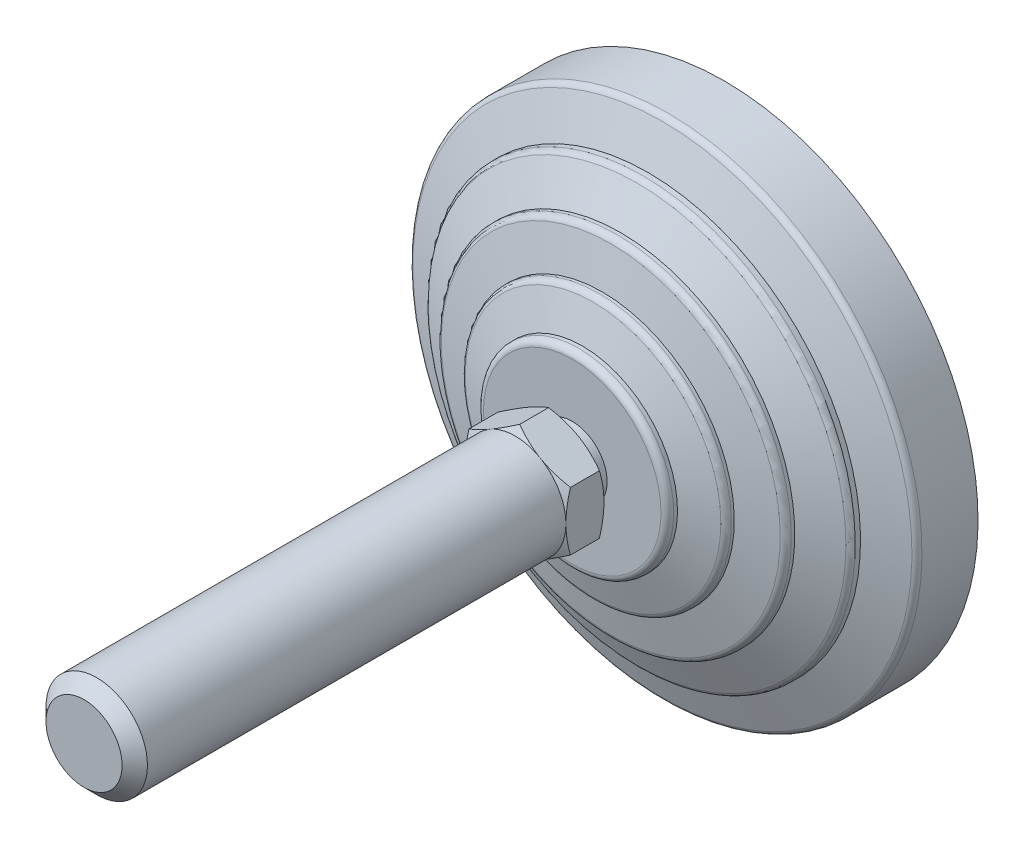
ISO-10303-21;
HEADER;
FILE_DESCRIPTION(('STEP AP214'),'2;1');
FILE_NAME('part.step','',(''),(''),'','','');
FILE_SCHEMA(('AUTOMOTIVE_DESIGN { 1 0 10303 214 1 1 1 1 }'));
ENDSEC;
DATA;
#1=APPLICATION_CONTEXT('core data for automotive mechanical design processes');
#2=APPLICATION_PROTOCOL_DEFINITION('international standard','automotive_design',2000,#1);
#3=PRODUCT_CONTEXT('',#1,'mechanical');
#4=PRODUCT('Part','Part','',(#3));
#5=PRODUCT_RELATED_PRODUCT_CATEGORY('part','',(#4));
#6=PRODUCT_DEFINITION_FORMATION('','',#4);
#7=PRODUCT_DEFINITION_CONTEXT('part definition',#1,'design');
#8=PRODUCT_DEFINITION('design','',#6,#7);
#9=PRODUCT_DEFINITION_SHAPE('','',#8);
#10=(LENGTH_UNIT() NAMED_UNIT(*) SI_UNIT(.MILLI.,.METRE.));
#11=(NAMED_UNIT(*) PLANE_ANGLE_UNIT() SI_UNIT($,.RADIAN.));
#12=(NAMED_UNIT(*) SI_UNIT($,.STERADIAN.) SOLID_ANGLE_UNIT());
#13=UNCERTAINTY_MEASURE_WITH_UNIT(LENGTH_MEASURE(1.E-05),#10,'distance_accuracy_value','');
#14=(GEOMETRIC_REPRESENTATION_CONTEXT(3) GLOBAL_UNCERTAINTY_ASSIGNED_CONTEXT((#13)) GLOBAL_UNIT_ASSIGNED_CONTEXT((#10,
#11,#12)) REPRESENTATION_CONTEXT('',''));
#15=CARTESIAN_POINT('',(0.,0.,0.));
#16=DIRECTION('',(0.,0.,1.));
#17=DIRECTION('',(1.,0.,0.));
#18=AXIS2_PLACEMENT_3D('',#15,#16,#17);
#19=CARTESIAN_POINT('',(-7.76470588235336,0.,27.));
#20=DIRECTION('',(0.,0.,1.));
#21=DIRECTION('',(0.,-1.,0.));
#22=AXIS2_PLACEMENT_3D('',#19,#20,#21);
#23=PLANE('',#22);
#24=CARTESIAN_POINT('',(0.,0.,27.));
#25=DIRECTION('',(0.,0.,-1.));
#26=DIRECTION('',(0.,1.,0.));
#27=AXIS2_PLACEMENT_3D('',#24,#25,#26);
#28=CIRCLE('',#27,5.5000000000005);
#29=CARTESIAN_POINT('',(0.,5.5000000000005,27.));
#30=VERTEX_POINT('',#29);
#31=EDGE_CURVE('E330',#30,#30,#28,.T.);
#32=ORIENTED_EDGE('',*,*,#31,.F.);
#33=EDGE_LOOP('',(#32));
#34=FACE_BOUND('',#33,.T.);
#35=CARTESIAN_POINT('',(0.,0.,27.));
#36=DIRECTION('',(0.,0.,-1.));
#37=DIRECTION('',(-1.,0.,0.));
#38=AXIS2_PLACEMENT_3D('',#35,#36,#37);
#39=CIRCLE('',#38,8.00000000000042);
#40=CARTESIAN_POINT('',(4.,6.92820323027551,27.));
#41=VERTEX_POINT('',#40);
#42=CARTESIAN_POINT('',(8.,0.,27.));
#43=VERTEX_POINT('',#42);
#44=EDGE_CURVE('E477',#41,#43,#39,.T.);
#45=ORIENTED_EDGE('',*,*,#44,.T.);
#46=CARTESIAN_POINT('',(4.,-6.92820323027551,27.));
#47=VERTEX_POINT('',#46);
#48=EDGE_CURVE('E140',#43,#47,#39,.T.);
#49=ORIENTED_EDGE('',*,*,#48,.T.);
#50=CARTESIAN_POINT('',(-4.,-6.92820323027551,27.));
#51=VERTEX_POINT('',#50);
#52=EDGE_CURVE('E139',#47,#51,#39,.T.);
#53=ORIENTED_EDGE('',*,*,#52,.T.);
#54=CARTESIAN_POINT('',(-8.,0.,27.));
#55=VERTEX_POINT('',#54);
#56=EDGE_CURVE('E117',#51,#55,#39,.T.);
#57=ORIENTED_EDGE('',*,*,#56,.T.);
#58=CARTESIAN_POINT('',(-4.,6.92820323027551,27.));
#59=VERTEX_POINT('',#58);
#60=EDGE_CURVE('E105',#55,#59,#39,.T.);
#61=ORIENTED_EDGE('',*,*,#60,.T.);
#62=EDGE_CURVE('E34',#59,#41,#39,.T.);
#63=ORIENTED_EDGE('',*,*,#62,.T.);
#64=EDGE_LOOP('',(#45,#49,#53,#57,#61,#63));
#65=FACE_BOUND('',#64,.T.);
#66=ADVANCED_FACE('F14',(#34,#65),#23,.F.);
#67=CARTESIAN_POINT('',(0.,0.,0.));
#68=DIRECTION('',(0.,0.,-1.));
#69=DIRECTION('',(0.,1.,0.));
#70=AXIS2_PLACEMENT_3D('',#67,#68,#69);
#71=CYLINDRICAL_SURFACE('',#70,5.5000000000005);
#72=CARTESIAN_POINT('',(0.,0.,24.));
#73=DIRECTION('',(0.,0.,-1.));
#74=DIRECTION('',(0.,1.,0.));
#75=AXIS2_PLACEMENT_3D('',#72,#73,#74);
#76=CIRCLE('',#75,5.5000000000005);
#77=CARTESIAN_POINT('',(0.,5.5000000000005,24.));
#78=VERTEX_POINT('',#77);
#79=EDGE_CURVE('E335',#78,#78,#76,.T.);
#80=ORIENTED_EDGE('',*,*,#79,.F.);
#81=EDGE_LOOP('',(#80));
#82=FACE_BOUND('',#81,.T.);
#83=ORIENTED_EDGE('',*,*,#31,.T.);
#84=EDGE_LOOP('',(#83));
#85=FACE_BOUND('',#84,.T.);
#86=ADVANCED_FACE('F297',(#82,#85),#71,.T.);
#87=CARTESIAN_POINT('',(-5.5000000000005,0.,24.));
#88=DIRECTION('',(0.,0.,-1.));
#89=DIRECTION('',(0.,1.,0.));
#90=AXIS2_PLACEMENT_3D('',#87,#88,#89);
#91=PLANE('',#90);
#92=CARTESIAN_POINT('',(0.,0.,24.));
#93=DIRECTION('',(0.,0.,-1.));
#94=DIRECTION('',(0.,1.,0.));
#95=AXIS2_PLACEMENT_3D('',#92,#93,#94);
#96=CIRCLE('',#95,13.9999999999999);
#97=CARTESIAN_POINT('',(0.,13.9999999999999,24.));
#98=VERTEX_POINT('',#97);
#99=EDGE_CURVE('E338',#98,#98,#96,.T.);
#100=ORIENTED_EDGE('',*,*,#99,.F.);
#101=EDGE_LOOP('',(#100));
#102=FACE_BOUND('',#101,.T.);
#103=ORIENTED_EDGE('',*,*,#79,.T.);
#104=EDGE_LOOP('',(#103));
#105=FACE_BOUND('',#104,.T.);
#106=ADVANCED_FACE('F293',(#102,#105),#91,.F.);
#107=CARTESIAN_POINT('',(0.,0.,23.));
#108=DIRECTION('',(0.,0.,-1.));
#109=DIRECTION('',(0.,1.,0.));
#110=AXIS2_PLACEMENT_3D('',#107,#108,#109);
#111=TOROIDAL_SURFACE('',#110,13.9999999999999,1.);
#112=CARTESIAN_POINT('',(0.,0.,23.));
#113=DIRECTION('',(0.,0.,-1.));
#114=DIRECTION('',(0.,1.,0.));
#115=AXIS2_PLACEMENT_3D('',#112,#113,#114);
#116=CIRCLE('',#115,14.9999999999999);
#117=CARTESIAN_POINT('',(0.,14.9999999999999,23.));
#118=VERTEX_POINT('',#117);
#119=EDGE_CURVE('E341',#118,#118,#116,.T.);
#120=ORIENTED_EDGE('',*,*,#119,.F.);
#121=EDGE_LOOP('',(#120));
#122=FACE_BOUND('',#121,.T.);
#123=ORIENTED_EDGE('',*,*,#99,.T.);
#124=EDGE_LOOP('',(#123));
#125=FACE_BOUND('',#124,.T.);
#126=ADVANCED_FACE('F289',(#122,#125),#111,.T.);
#127=CARTESIAN_POINT('',(0.,0.,0.));
#128=DIRECTION('',(0.,0.,-1.));
#129=DIRECTION('',(0.,1.,0.));
#130=AXIS2_PLACEMENT_3D('',#127,#128,#129);
#131=CYLINDRICAL_SURFACE('',#130,14.9999999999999);
#132=CARTESIAN_POINT('',(0.,0.,22.4025287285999));
#133=DIRECTION('',(0.,0.,-1.));
#134=DIRECTION('',(0.,1.,0.));
#135=AXIS2_PLACEMENT_3D('',#132,#133,#134);
#136=CIRCLE('',#135,14.9999999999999);
#137=CARTESIAN_POINT('',(0.,14.9999999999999,22.4025287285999));
#138=VERTEX_POINT('',#137);
#139=EDGE_CURVE('E344',#138,#138,#136,.T.);
#140=ORIENTED_EDGE('',*,*,#139,.F.);
#141=EDGE_LOOP('',(#140));
#142=FACE_BOUND('',#141,.T.);
#143=ORIENTED_EDGE('',*,*,#119,.T.);
#144=EDGE_LOOP('',(#143));
#145=FACE_BOUND('',#144,.T.);
#146=ADVANCED_FACE('F285',(#142,#145),#131,.T.);
#147=CARTESIAN_POINT('',(0.,0.,22.4025287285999));
#148=DIRECTION('',(0.,0.,-1.));
#149=DIRECTION('',(0.,1.,0.));
#150=AXIS2_PLACEMENT_3D('',#147,#148,#149);
#151=CONICAL_SURFACE('',#150,14.9999999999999,1.25589726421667);
#152=CARTESIAN_POINT('',(0.,0.,20.7216684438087));
#153=DIRECTION('',(0.,0.,-1.));
#154=DIRECTION('',(0.,1.,0.));
#155=AXIS2_PLACEMENT_3D('',#152,#153,#154);
#156=CIRCLE('',#155,20.1601635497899);
#157=CARTESIAN_POINT('',(0.,20.1601635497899,20.7216684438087));
#158=VERTEX_POINT('',#157);
#159=EDGE_CURVE('E347',#158,#158,#156,.T.);
#160=ORIENTED_EDGE('',*,*,#159,.F.);
#161=EDGE_LOOP('',(#160));
#162=FACE_BOUND('',#161,.T.);
#163=ORIENTED_EDGE('',*,*,#139,.T.);
#164=EDGE_LOOP('',(#163));
#165=FACE_BOUND('',#164,.T.);
#166=ADVANCED_FACE('F281',(#162,#165),#151,.T.);
#167=CARTESIAN_POINT('',(0.,0.,19.7708407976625));
#168=DIRECTION('',(0.,0.,-1.));
#169=DIRECTION('',(0.,1.,0.));
#170=AXIS2_PLACEMENT_3D('',#167,#168,#169);
#171=TOROIDAL_SURFACE('',#170,19.8504430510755,1.);
#172=CARTESIAN_POINT('',(0.,0.,19.7708407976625));
#173=DIRECTION('',(0.,0.,-1.));
#174=DIRECTION('',(0.,1.,0.));
#175=AXIS2_PLACEMENT_3D('',#172,#173,#174);
#176=CIRCLE('',#175,20.8504430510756);
#177=CARTESIAN_POINT('',(0.,20.8504430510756,19.7708407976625));
#178=VERTEX_POINT('',#177);
#179=EDGE_CURVE('E350',#178,#178,#176,.T.);
#180=ORIENTED_EDGE('',*,*,#179,.F.);
#181=EDGE_LOOP('',(#180));
#182=FACE_BOUND('',#181,.T.);
#183=ORIENTED_EDGE('',*,*,#159,.T.);
#184=EDGE_LOOP('',(#183));
#185=FACE_BOUND('',#184,.T.);
#186=ADVANCED_FACE('F277',(#182,#185),#171,.T.);
#187=CARTESIAN_POINT('',(0.,0.,0.));
#188=DIRECTION('',(0.,0.,-1.));
#189=DIRECTION('',(0.,1.,0.));
#190=AXIS2_PLACEMENT_3D('',#187,#188,#189);
#191=CYLINDRICAL_SURFACE('',#190,20.8504430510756);
#192=CARTESIAN_POINT('',(0.,0.,19.2987385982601));
#193=DIRECTION('',(0.,0.,-1.));
#194=DIRECTION('',(0.,1.,0.));
#195=AXIS2_PLACEMENT_3D('',#192,#193,#194);
#196=CIRCLE('',#195,20.8504430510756);
#197=CARTESIAN_POINT('',(0.,20.8504430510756,19.2987385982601));
#198=VERTEX_POINT('',#197);
#199=EDGE_CURVE('E353',#198,#198,#196,.T.);
#200=ORIENTED_EDGE('',*,*,#199,.F.);
#201=EDGE_LOOP('',(#200));
#202=FACE_BOUND('',#201,.T.);
#203=ORIENTED_EDGE('',*,*,#179,.T.);
#204=EDGE_LOOP('',(#203));
#205=FACE_BOUND('',#204,.T.);
#206=ADVANCED_FACE('F273',(#202,#205),#191,.T.);
#207=CARTESIAN_POINT('',(0.,0.,19.2987385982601));
#208=DIRECTION('',(0.,0.,-1.));
#209=DIRECTION('',(0.,1.,0.));
#210=AXIS2_PLACEMENT_3D('',#207,#208,#209);
#211=CONICAL_SURFACE('',#210,20.8504430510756,1.34067144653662);
#212=CARTESIAN_POINT('',(0.,0.,17.9217501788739));
#213=DIRECTION('',(0.,0.,-1.));
#214=DIRECTION('',(0.,1.,0.));
#215=AXIS2_PLACEMENT_3D('',#212,#213,#214);
#216=CIRCLE('',#215,26.7280991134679);
#217=CARTESIAN_POINT('',(0.,26.7280991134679,17.9217501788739));
#218=VERTEX_POINT('',#217);
#219=EDGE_CURVE('E356',#218,#218,#216,.T.);
#220=ORIENTED_EDGE('',*,*,#219,.F.);
#221=EDGE_LOOP('',(#220));
#222=FACE_BOUND('',#221,.T.);
#223=ORIENTED_EDGE('',*,*,#199,.T.);
#224=EDGE_LOOP('',(#223));
#225=FACE_BOUND('',#224,.T.);
#226=ADVANCED_FACE('F269',(#222,#225),#211,.T.);
#227=CARTESIAN_POINT('',(0.,0.,16.9481122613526));
#228=DIRECTION('',(0.,0.,-1.));
#229=DIRECTION('',(0.,1.,0.));
#230=AXIS2_PLACEMENT_3D('',#227,#228,#229);
#231=TOROIDAL_SURFACE('',#230,26.5,1.);
#232=CARTESIAN_POINT('',(0.,0.,16.9481122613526));
#233=DIRECTION('',(0.,0.,-1.));
#234=DIRECTION('',(0.,1.,0.));
#235=AXIS2_PLACEMENT_3D('',#232,#233,#234);
#236=CIRCLE('',#235,27.5);
#237=CARTESIAN_POINT('',(0.,27.5,16.9481122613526));
#238=VERTEX_POINT('',#237);
#239=EDGE_CURVE('E359',#238,#238,#236,.T.);
#240=ORIENTED_EDGE('',*,*,#239,.F.);
#241=EDGE_LOOP('',(#240));
#242=FACE_BOUND('',#241,.T.);
#243=ORIENTED_EDGE('',*,*,#219,.T.);
#244=EDGE_LOOP('',(#243));
#245=FACE_BOUND('',#244,.T.);
#246=ADVANCED_FACE('F265',(#242,#245),#231,.T.);
#247=CARTESIAN_POINT('',(0.,0.,0.));
#248=DIRECTION('',(0.,0.,-1.));
#249=DIRECTION('',(0.,1.,0.));
#250=AXIS2_PLACEMENT_3D('',#247,#248,#249);
#251=CYLINDRICAL_SURFACE('',#250,27.5);
#252=CARTESIAN_POINT('',(0.,0.,16.4025287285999));
#253=DIRECTION('',(0.,0.,-1.));
#254=DIRECTION('',(0.,1.,0.));
#255=AXIS2_PLACEMENT_3D('',#252,#253,#254);
#256=CIRCLE('',#255,27.5);
#257=CARTESIAN_POINT('',(0.,27.5,16.4025287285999));
#258=VERTEX_POINT('',#257);
#259=EDGE_CURVE('E362',#258,#258,#256,.T.);
#260=ORIENTED_EDGE('',*,*,#259,.F.);
#261=EDGE_LOOP('',(#260));
#262=FACE_BOUND('',#261,.T.);
#263=ORIENTED_EDGE('',*,*,#239,.T.);
#264=EDGE_LOOP('',(#263));
#265=FACE_BOUND('',#264,.T.);
#266=ADVANCED_FACE('F261',(#262,#265),#251,.T.);
#267=CARTESIAN_POINT('',(0.,0.,16.4025287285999));
#268=DIRECTION('',(0.,0.,-1.));
#269=DIRECTION('',(0.,1.,0.));
#270=AXIS2_PLACEMENT_3D('',#267,#268,#269);
#271=CONICAL_SURFACE('',#270,27.5,1.12022914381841);
#272=CARTESIAN_POINT('',(0.,0.,13.7730910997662));
#273=DIRECTION('',(0.,0.,-1.));
#274=DIRECTION('',(0.,1.,0.));
#275=AXIS2_PLACEMENT_3D('',#272,#273,#274);
#276=CIRCLE('',#275,32.935476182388);
#277=CARTESIAN_POINT('',(0.,32.935476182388,13.7730910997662));
#278=VERTEX_POINT('',#277);
#279=EDGE_CURVE('E365',#278,#278,#276,.T.);
#280=ORIENTED_EDGE('',*,*,#279,.F.);
#281=EDGE_LOOP('',(#280));
#282=FACE_BOUND('',#281,.T.);
#283=ORIENTED_EDGE('',*,*,#259,.T.);
#284=EDGE_LOOP('',(#283));
#285=FACE_BOUND('',#284,.T.);
#286=ADVANCED_FACE('F257',(#282,#285),#271,.T.);
#287=CARTESIAN_POINT('',(0.,0.,12.8728908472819));
#288=DIRECTION('',(0.,0.,-1.));
#289=DIRECTION('',(0.,1.,0.));
#290=AXIS2_PLACEMENT_3D('',#287,#288,#289);
#291=TOROIDAL_SURFACE('',#290,32.5,1.);
#292=CARTESIAN_POINT('',(0.,0.,12.8728908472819));
#293=DIRECTION('',(0.,0.,-1.));
#294=DIRECTION('',(0.,1.,0.));
#295=AXIS2_PLACEMENT_3D('',#292,#293,#294);
#296=CIRCLE('',#295,33.5);
#297=CARTESIAN_POINT('',(0.,33.5,12.8728908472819));
#298=VERTEX_POINT('',#297);
#299=EDGE_CURVE('E368',#298,#298,#296,.T.);
#300=ORIENTED_EDGE('',*,*,#299,.F.);
#301=EDGE_LOOP('',(#300));
#302=FACE_BOUND('',#301,.T.);
#303=ORIENTED_EDGE('',*,*,#279,.T.);
#304=EDGE_LOOP('',(#303));
#305=FACE_BOUND('',#304,.T.);
#306=ADVANCED_FACE('F253',(#302,#305),#291,.T.);
#307=CARTESIAN_POINT('',(0.,0.,0.));
#308=DIRECTION('',(0.,0.,-1.));
#309=DIRECTION('',(0.,1.,0.));
#310=AXIS2_PLACEMENT_3D('',#307,#308,#309);
#311=CYLINDRICAL_SURFACE('',#310,33.5);
#312=CARTESIAN_POINT('',(0.,0.,12.0315037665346));
#313=DIRECTION('',(0.,0.,-1.));
#314=DIRECTION('',(0.,1.,0.));
#315=AXIS2_PLACEMENT_3D('',#312,#313,#314);
#316=CIRCLE('',#315,33.5);
#317=CARTESIAN_POINT('',(0.,33.5,12.0315037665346));
#318=VERTEX_POINT('',#317);
#319=EDGE_CURVE('E371',#318,#318,#316,.T.);
#320=ORIENTED_EDGE('',*,*,#319,.F.);
#321=EDGE_LOOP('',(#320));
#322=FACE_BOUND('',#321,.T.);
#323=ORIENTED_EDGE('',*,*,#299,.T.);
#324=EDGE_LOOP('',(#323));
#325=FACE_BOUND('',#324,.T.);
#326=ADVANCED_FACE('F249',(#322,#325),#311,.T.);
#327=CARTESIAN_POINT('',(0.,0.,12.0315037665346));
#328=DIRECTION('',(0.,0.,-1.));
#329=DIRECTION('',(0.,1.,0.));
#330=AXIS2_PLACEMENT_3D('',#327,#328,#329);
#331=CONICAL_SURFACE('',#330,33.5,1.20362249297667);
#332=CARTESIAN_POINT('',(0.,0.,9.77805027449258));
#333=DIRECTION('',(0.,0.,-1.));
#334=DIRECTION('',(0.,1.,0.));
#335=AXIS2_PLACEMENT_3D('',#332,#333,#334);
#336=CIRCLE('',#335,39.3589790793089);
#337=CARTESIAN_POINT('',(0.,39.3589790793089,9.77805027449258));
#338=VERTEX_POINT('',#337);
#339=EDGE_CURVE('E374',#338,#338,#336,.T.);
#340=ORIENTED_EDGE('',*,*,#339,.F.);
#341=EDGE_LOOP('',(#340));
#342=FACE_BOUND('',#341,.T.);
#343=ORIENTED_EDGE('',*,*,#319,.T.);
#344=EDGE_LOOP('',(#343));
#345=FACE_BOUND('',#344,.T.);
#346=ADVANCED_FACE('F245',(#342,#345),#331,.T.);
#347=CARTESIAN_POINT('',(0.,0.,8.84470466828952));
#348=DIRECTION('',(0.,0.,-1.));
#349=DIRECTION('',(0.,1.,0.));
#350=AXIS2_PLACEMENT_3D('',#347,#348,#349);
#351=TOROIDAL_SURFACE('',#350,39.,1.);
#352=CARTESIAN_POINT('',(0.,0.,8.84470466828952));
#353=DIRECTION('',(0.,0.,-1.));
#354=DIRECTION('',(0.,1.,0.));
#355=AXIS2_PLACEMENT_3D('',#352,#353,#354);
#356=CIRCLE('',#355,40.);
#357=CARTESIAN_POINT('',(0.,40.,8.84470466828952));
#358=VERTEX_POINT('',#357);
#359=EDGE_CURVE('E377',#358,#358,#356,.T.);
#360=ORIENTED_EDGE('',*,*,#359,.F.);
#361=EDGE_LOOP('',(#360));
#362=FACE_BOUND('',#361,.T.);
#363=ORIENTED_EDGE('',*,*,#339,.T.);
#364=EDGE_LOOP('',(#363));
#365=FACE_BOUND('',#364,.T.);
#366=ADVANCED_FACE('F241',(#362,#365),#351,.T.);
#367=CARTESIAN_POINT('',(0.,0.,0.));
#368=DIRECTION('',(0.,0.,-1.));
#369=DIRECTION('',(0.,1.,0.));
#370=AXIS2_PLACEMENT_3D('',#367,#368,#369);
#371=CYLINDRICAL_SURFACE('',#370,40.);
#372=CARTESIAN_POINT('',(0.,0.,0.));
#373=DIRECTION('',(0.,0.,-1.));
#374=DIRECTION('',(0.,1.,0.));
#375=AXIS2_PLACEMENT_3D('',#372,#373,#374);
#376=CIRCLE('',#375,40.);
#377=CARTESIAN_POINT('',(0.,40.,0.));
#378=VERTEX_POINT('',#377);
#379=EDGE_CURVE('E380',#378,#378,#376,.T.);
#380=ORIENTED_EDGE('',*,*,#379,.F.);
#381=EDGE_LOOP('',(#380));
#382=FACE_BOUND('',#381,.T.);
#383=ORIENTED_EDGE('',*,*,#359,.T.);
#384=EDGE_LOOP('',(#383));
#385=FACE_BOUND('',#384,.T.);
#386=ADVANCED_FACE('F237',(#382,#385),#371,.T.);
#387=CARTESIAN_POINT('',(0.,0.,0.));
#388=DIRECTION('',(0.,0.,1.));
#389=DIRECTION('',(0.,-1.,0.));
#390=AXIS2_PLACEMENT_3D('',#387,#388,#389);
#391=PLANE('',#390);
#392=ORIENTED_EDGE('',*,*,#379,.T.);
#393=EDGE_LOOP('',(#392));
#394=FACE_BOUND('',#393,.T.);
#395=ADVANCED_FACE('F233',(#394),#391,.F.);
#396=CARTESIAN_POINT('',(0.,0.,28.494635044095));
#397=DIRECTION('',(0.,0.,1.));
#398=DIRECTION('',(1.,0.,0.));
#399=AXIS2_PLACEMENT_3D('',#396,#397,#398);
#400=CONICAL_SURFACE('',#399,10.5887838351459,1.0471975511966);
#401=CARTESIAN_POINT('',(8.,-12.3582773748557,30.8807472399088));
#402=CARTESIAN_POINT('',(8.,-12.0092731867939,30.7116440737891));
#403=CARTESIAN_POINT('',(8.,-11.6594626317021,30.5441763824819));
#404=CARTESIAN_POINT('',(8.,-10.9577997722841,30.2134327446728));
#405=CARTESIAN_POINT('',(8.,-10.6059471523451,30.0501574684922));
#406=CARTESIAN_POINT('',(8.,-9.8979349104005,29.7278876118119));
#407=CARTESIAN_POINT('',(8.,-9.5417622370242,29.5689216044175));
#408=CARTESIAN_POINT('',(8.,-8.82656714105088,29.2575598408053));
#409=CARTESIAN_POINT('',(8.,-8.46754485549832,29.1051637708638));
#410=CARTESIAN_POINT('',(8.,-7.73466734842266,28.8039883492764));
#411=CARTESIAN_POINT('',(8.,-7.3607019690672,28.655475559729));
#412=CARTESIAN_POINT('',(8.,-6.6083790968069,28.3698075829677));
#413=CARTESIAN_POINT('',(8.,-6.23002111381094,28.2326536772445));
#414=CARTESIAN_POINT('',(8.,-5.46903052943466,27.9733400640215));
#415=CARTESIAN_POINT('',(8.,-5.08640853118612,27.8511495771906));
#416=CARTESIAN_POINT('',(8.,-4.31569024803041,27.6257139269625));
#417=CARTESIAN_POINT('',(8.,-3.92759574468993,27.52246274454));
#418=CARTESIAN_POINT('',(8.,-3.14779823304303,27.3404476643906));
#419=CARTESIAN_POINT('',(8.,-2.75612673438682,27.2615524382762));
#420=CARTESIAN_POINT('',(8.,-2.16509177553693,27.164914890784));
#421=CARTESIAN_POINT('',(8.,-1.96747725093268,27.136318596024));
#422=CARTESIAN_POINT('',(8.,-1.57128250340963,27.0869230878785));
#423=CARTESIAN_POINT('',(8.,-1.37270237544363,27.066123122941));
#424=CARTESIAN_POINT('',(8.,-0.977414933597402,27.0329929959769));
#425=CARTESIAN_POINT('',(8.,-0.78071652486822,27.0205569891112));
#426=CARTESIAN_POINT('',(8.,-0.386970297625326,27.004010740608));
#427=CARTESIAN_POINT('',(8.,-0.189922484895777,26.9999003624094));
#428=CARTESIAN_POINT('',(8.,0.204170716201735,27.0001033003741));
#429=CARTESIAN_POINT('',(8.,0.401216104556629,27.0044166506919));
#430=CARTESIAN_POINT('',(8.,0.794951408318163,27.0213624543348));
#431=CARTESIAN_POINT('',(8.,0.991641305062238,27.0339953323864));
#432=CARTESIAN_POINT('',(8.,1.46583605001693,27.0742148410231));
#433=CARTESIAN_POINT('',(8.,1.74300614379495,27.1058314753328));
#434=CARTESIAN_POINT('',(8.,2.29524408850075,27.1838489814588));
#435=CARTESIAN_POINT('',(8.,2.57031164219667,27.2302519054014));
#436=CARTESIAN_POINT('',(8.,3.39207221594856,27.3891756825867));
#437=CARTESIAN_POINT('',(8.,3.93500619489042,27.5213811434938));
#438=CARTESIAN_POINT('',(8.,4.74674898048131,27.7500640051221));
#439=CARTESIAN_POINT('',(8.,5.01978302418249,27.8324011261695));
#440=CARTESIAN_POINT('',(8.,5.56319838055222,28.005485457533));
#441=CARTESIAN_POINT('',(8.,5.83357967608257,28.0962327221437));
#442=CARTESIAN_POINT('',(8.,6.37177709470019,28.2846931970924));
#443=CARTESIAN_POINT('',(8.,6.63959406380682,28.3824040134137));
#444=CARTESIAN_POINT('',(8.,7.1730189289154,28.5836561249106));
#445=CARTESIAN_POINT('',(8.,7.43862684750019,28.6871973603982));
#446=CARTESIAN_POINT('',(8.,8.05155777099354,28.9326494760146));
#447=CARTESIAN_POINT('',(8.,8.3981660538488,29.0763415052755));
#448=CARTESIAN_POINT('',(8.,9.0885424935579,29.3704123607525));
#449=CARTESIAN_POINT('',(8.,9.43231049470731,29.5207915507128));
#450=CARTESIAN_POINT('',(8.,10.117510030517,29.8269333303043));
#451=CARTESIAN_POINT('',(8.,10.4589411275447,29.9826968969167));
#452=CARTESIAN_POINT('',(8.,11.1397942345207,30.2985622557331));
#453=CARTESIAN_POINT('',(8.,11.4792162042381,30.4586641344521));
#454=CARTESIAN_POINT('',(8.,12.1566999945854,30.7825718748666));
#455=CARTESIAN_POINT('',(8.,12.4947601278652,30.9463812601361));
#456=CARTESIAN_POINT('',(8.,13.1694432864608,31.2769359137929));
#457=CARTESIAN_POINT('',(8.,13.5060662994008,31.4436812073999));
#458=CARTESIAN_POINT('',(8.,14.5140322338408,31.9475195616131));
#459=CARTESIAN_POINT('',(8.,15.1835544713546,32.2882548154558));
#460=CARTESIAN_POINT('',(8.,16.4652884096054,32.9489106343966));
#461=CARTESIAN_POINT('',(8.,17.0777755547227,33.2682991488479));
#462=CARTESIAN_POINT('',(8.,18.3004501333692,33.9114919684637));
#463=CARTESIAN_POINT('',(8.,18.9106374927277,34.2352964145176));
#464=CARTESIAN_POINT('',(8.,20.1277807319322,34.8855208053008));
#465=CARTESIAN_POINT('',(8.,20.7347408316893,35.2119328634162));
#466=CARTESIAN_POINT('',(8.,21.9471818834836,35.8674188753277));
#467=CARTESIAN_POINT('',(8.,22.5526629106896,36.1964926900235));
#468=CARTESIAN_POINT('',(8.,23.1575954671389,36.5265649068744));
#469=B_SPLINE_CURVE_WITH_KNOTS('',3,(#401,#402,#403,#404,#405,#406,#407,#408,#409,#410,#411,
#412,#413,#414,#415,#416,#417,#418,#419,#420,#421,#422,#423,#424,#425,#426,#427,#428,#429,#430,
#431,#432,#433,#434,#435,#436,#437,#438,#439,#440,#441,#442,#443,#444,#445,#446,#447,#448,#449,
#450,#451,#452,#453,#454,#455,#456,#457,#458,#459,#460,#461,#462,#463,#464,#465,#466,#467,#468),
.UNSPECIFIED.,.F.,.F.,(4,2,2,2,2,2,2,2,2,2,2,2,2,2,2,2,2,2,2,2,2,2,2,2,2,2,2,2,2,2,2,2,2,4),(0.,
1.16345684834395,2.32709857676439,3.49715760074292,4.66716069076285,5.87414446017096,
7.0812642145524,8.28585769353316,9.49006767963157,10.6876662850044,11.2865552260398,
11.885386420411,12.476489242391,13.0675823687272,13.6586778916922,14.2498035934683,
15.086232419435,15.9227773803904,17.5968182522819,18.4522853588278,19.3077579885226,
20.1629379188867,21.0181090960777,22.1436547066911,23.2692616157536,24.3950738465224,
25.5209085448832,26.6478623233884,27.7748257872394,30.0284782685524,32.1007393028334,
34.1730666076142,36.2405480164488,38.307922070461),.UNSPECIFIED.);
#470=CARTESIAN_POINT('',(8.,4.61880215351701,27.714531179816));
#471=VERTEX_POINT('',#470);
#472=EDGE_CURVE('E115',#471,#43,#469,.F.);
#473=ORIENTED_EDGE('',*,*,#472,.T.);
#474=ORIENTED_EDGE('',*,*,#44,.F.);
#475=CARTESIAN_POINT('',(-0.00019999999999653,9.23771977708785,27.7145978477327));
#476=CARTESIAN_POINT('',(0.175648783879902,9.13619343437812,27.655990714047));
#477=CARTESIAN_POINT('',(0.352153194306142,9.03428856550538,27.600043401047));
#478=CARTESIAN_POINT('',(0.706595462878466,8.82965122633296,27.4942010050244));
#479=CARTESIAN_POINT('',(0.884533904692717,8.72691841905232,27.4443085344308));
#480=CARTESIAN_POINT('',(1.42119823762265,8.41707512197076,27.3046927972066));
#481=CARTESIAN_POINT('',(1.78204258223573,8.20874154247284,27.2252811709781));
#482=CARTESIAN_POINT('',(2.32203917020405,7.89697436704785,27.1321616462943));
#483=CARTESIAN_POINT('',(2.49957818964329,7.79447216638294,27.1056345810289));
#484=CARTESIAN_POINT('',(2.8554591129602,7.58900421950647,27.0611531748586));
#485=CARTESIAN_POINT('',(3.03380094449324,7.4860385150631,27.0431980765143));
#486=CARTESIAN_POINT('',(3.3907916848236,7.27992981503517,27.0163156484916));
#487=CARTESIAN_POINT('',(3.5694400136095,7.17678715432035,27.007378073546));
#488=CARTESIAN_POINT('',(3.92690170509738,6.97040655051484,26.9987223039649));
#489=CARTESIAN_POINT('',(4.10571506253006,6.86716861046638,26.9990038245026));
#490=CARTESIAN_POINT('',(4.4400133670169,6.67416139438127,27.0081450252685));
#491=CARTESIAN_POINT('',(4.59552190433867,6.58437849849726,27.0158896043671));
#492=CARTESIAN_POINT('',(4.90617476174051,6.40502298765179,27.0382011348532));
#493=CARTESIAN_POINT('',(5.06131905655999,6.31545038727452,27.0527685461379));
#494=CARTESIAN_POINT('',(5.52615131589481,6.04707935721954,27.1063606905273));
#495=CARTESIAN_POINT('',(5.83501648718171,5.86875596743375,27.1552686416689));
#496=CARTESIAN_POINT('',(6.45602322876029,5.51021755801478,27.2775394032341));
#497=CARTESIAN_POINT('',(6.76808554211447,5.33004829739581,27.3514205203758));
#498=CARTESIAN_POINT('',(7.38755648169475,4.97239658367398,27.5191001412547));
#499=CARTESIAN_POINT('',(7.69497304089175,4.79490955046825,27.6128592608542));
#500=CARTESIAN_POINT('',(8.0002,4.61868668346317,27.7145978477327));
#501=B_SPLINE_CURVE_WITH_KNOTS('',3,(#475,#476,#477,#478,#479,#480,#481,#482,#483,#484,#485,
#486,#487,#488,#489,#490,#491,#492,#493,#494,#495,#496,#497,#498,#499,#500),.UNSPECIFIED.,.F.,
.F.,(4,2,2,2,2,2,2,2,2,2,2,2,4),(0.,0.633973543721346,1.26821965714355,2.53934712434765,
3.15934343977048,3.77928496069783,4.39852133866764,5.01773858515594,5.55680239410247,
6.09590254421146,7.17487077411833,8.2777685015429,9.37850115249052),.UNSPECIFIED.);
#502=EDGE_CURVE('E18',#41,#471,#501,.T.);
#503=ORIENTED_EDGE('',*,*,#502,.T.);
#504=EDGE_LOOP('',(#473,#474,#503));
#505=FACE_BOUND('',#504,.T.);
#506=ADVANCED_FACE('F157',(#505),#400,.T.);
#507=CARTESIAN_POINT('',(-8.0002,4.61868668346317,27.7145978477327));
#508=CARTESIAN_POINT('',(-7.8243512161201,4.7202130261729,27.655990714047));
#509=CARTESIAN_POINT('',(-7.64784680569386,4.82211789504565,27.600043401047));
#510=CARTESIAN_POINT('',(-7.29340453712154,5.02675523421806,27.4942010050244));
#511=CARTESIAN_POINT('',(-7.11546609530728,5.1294880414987,27.4443085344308));
#512=CARTESIAN_POINT('',(-6.57880176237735,5.43933133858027,27.3046927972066));
#513=CARTESIAN_POINT('',(-6.21795741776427,5.64766491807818,27.2252811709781));
#514=CARTESIAN_POINT('',(-5.67796082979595,5.95943209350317,27.1321616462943));
#515=CARTESIAN_POINT('',(-5.50042181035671,6.06193429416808,27.1056345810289));
#516=CARTESIAN_POINT('',(-5.1445408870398,6.26740224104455,27.0611531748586));
#517=CARTESIAN_POINT('',(-4.96619905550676,6.37036794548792,27.0431980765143));
#518=CARTESIAN_POINT('',(-4.6092083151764,6.57647664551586,27.0163156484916));
#519=CARTESIAN_POINT('',(-4.4305599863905,6.67961930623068,27.007378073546));
#520=CARTESIAN_POINT('',(-4.07309829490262,6.88599991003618,26.9987223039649));
#521=CARTESIAN_POINT('',(-3.89428493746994,6.98923785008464,26.9990038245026));
#522=CARTESIAN_POINT('',(-3.5599866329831,7.18224506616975,27.0081450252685));
#523=CARTESIAN_POINT('',(-3.40447809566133,7.27202796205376,27.0158896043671));
#524=CARTESIAN_POINT('',(-3.09382523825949,7.45138347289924,27.0382011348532));
#525=CARTESIAN_POINT('',(-2.93868094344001,7.5409560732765,27.0527685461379));
#526=CARTESIAN_POINT('',(-2.47384868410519,7.80932710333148,27.1063606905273));
#527=CARTESIAN_POINT('',(-2.16498351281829,7.98765049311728,27.1552686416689));
#528=CARTESIAN_POINT('',(-1.54397677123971,8.34618890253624,27.2775394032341));
#529=CARTESIAN_POINT('',(-1.23191445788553,8.52635816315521,27.3514205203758));
#530=CARTESIAN_POINT('',(-0.612443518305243,8.88400987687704,27.5191001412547));
#531=CARTESIAN_POINT('',(-0.30502695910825,9.06149691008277,27.6128592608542));
#532=CARTESIAN_POINT('',(0.000200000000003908,9.23771977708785,27.7145978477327));
#533=B_SPLINE_CURVE_WITH_KNOTS('',3,(#507,#508,#509,#510,#511,#512,#513,#514,#515,#516,#517,
#518,#519,#520,#521,#522,#523,#524,#525,#526,#527,#528,#529,#530,#531,#532),.UNSPECIFIED.,.F.,
.F.,(4,2,2,2,2,2,2,2,2,2,2,2,4),(0.,0.633973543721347,1.26821965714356,2.53934712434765,
3.15934343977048,3.77928496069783,4.39852133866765,5.01773858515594,5.55680239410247,
6.09590254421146,7.17487077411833,8.27776850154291,9.37850115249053),.UNSPECIFIED.);
#534=CARTESIAN_POINT('',(0.,9.23760430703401,27.714531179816));
#535=VERTEX_POINT('',#534);
#536=EDGE_CURVE('E149',#59,#535,#533,.T.);
#537=ORIENTED_EDGE('',*,*,#536,.T.);
#538=EDGE_CURVE('E9',#535,#41,#501,.T.);
#539=ORIENTED_EDGE('',*,*,#538,.T.);
#540=ORIENTED_EDGE('',*,*,#62,.F.);
#541=EDGE_LOOP('',(#537,#539,#540));
#542=FACE_BOUND('',#541,.T.);
#543=ADVANCED_FACE('F470',(#542),#400,.T.);
#544=CARTESIAN_POINT('',(8.0002,-4.61868668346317,27.7145978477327));
#545=CARTESIAN_POINT('',(7.8243512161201,-4.7202130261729,27.655990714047));
#546=CARTESIAN_POINT('',(7.64784680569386,-4.82211789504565,27.600043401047));
#547=CARTESIAN_POINT('',(7.29340453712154,-5.02675523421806,27.4942010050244));
#548=CARTESIAN_POINT('',(7.11546609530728,-5.1294880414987,27.4443085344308));
#549=CARTESIAN_POINT('',(6.57880176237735,-5.43933133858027,27.3046927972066));
#550=CARTESIAN_POINT('',(6.21795741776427,-5.64766491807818,27.2252811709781));
#551=CARTESIAN_POINT('',(5.67796082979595,-5.95943209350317,27.1321616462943));
#552=CARTESIAN_POINT('',(5.50042181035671,-6.06193429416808,27.1056345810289));
#553=CARTESIAN_POINT('',(5.1445408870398,-6.26740224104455,27.0611531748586));
#554=CARTESIAN_POINT('',(4.96619905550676,-6.37036794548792,27.0431980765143));
#555=CARTESIAN_POINT('',(4.6092083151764,-6.57647664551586,27.0163156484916));
#556=CARTESIAN_POINT('',(4.4305599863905,-6.67961930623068,27.007378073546));
#557=CARTESIAN_POINT('',(4.07309829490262,-6.88599991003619,26.9987223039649));
#558=CARTESIAN_POINT('',(3.89428493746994,-6.98923785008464,26.9990038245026));
#559=CARTESIAN_POINT('',(3.5599866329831,-7.18224506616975,27.0081450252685));
#560=CARTESIAN_POINT('',(3.40447809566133,-7.27202796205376,27.0158896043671));
#561=CARTESIAN_POINT('',(3.09382523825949,-7.45138347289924,27.0382011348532));
#562=CARTESIAN_POINT('',(2.93868094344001,-7.5409560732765,27.0527685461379));
#563=CARTESIAN_POINT('',(2.47384868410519,-7.80932710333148,27.1063606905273));
#564=CARTESIAN_POINT('',(2.16498351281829,-7.98765049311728,27.1552686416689));
#565=CARTESIAN_POINT('',(1.54397677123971,-8.34618890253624,27.2775394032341));
#566=CARTESIAN_POINT('',(1.23191445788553,-8.52635816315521,27.3514205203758));
#567=CARTESIAN_POINT('',(0.612443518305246,-8.88400987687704,27.5191001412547));
#568=CARTESIAN_POINT('',(0.305026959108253,-9.06149691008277,27.6128592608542));
#569=CARTESIAN_POINT('',(-0.000199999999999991,-9.23771977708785,27.7145978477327));
#570=B_SPLINE_CURVE_WITH_KNOTS('',3,(#544,#545,#546,#547,#548,#549,#550,#551,#552,#553,#554,
#555,#556,#557,#558,#559,#560,#561,#562,#563,#564,#565,#566,#567,#568,#569),.UNSPECIFIED.,.F.,
.F.,(4,2,2,2,2,2,2,2,2,2,2,2,4),(0.,0.633973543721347,1.26821965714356,2.53934712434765,
3.15934343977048,3.77928496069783,4.39852133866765,5.01773858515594,5.55680239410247,
6.09590254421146,7.17487077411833,8.27776850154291,9.37850115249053),.UNSPECIFIED.);
#571=CARTESIAN_POINT('',(8.,-4.61880215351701,27.714531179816));
#572=VERTEX_POINT('',#571);
#573=EDGE_CURVE('E135',#572,#47,#570,.T.);
#574=ORIENTED_EDGE('',*,*,#573,.T.);
#575=ORIENTED_EDGE('',*,*,#48,.F.);
#576=EDGE_CURVE('E150',#43,#572,#469,.F.);
#577=ORIENTED_EDGE('',*,*,#576,.T.);
#578=EDGE_LOOP('',(#574,#575,#577));
#579=FACE_BOUND('',#578,.T.);
#580=ADVANCED_FACE('F464',(#579),#400,.T.);
#581=CARTESIAN_POINT('',(0.000200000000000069,-9.23771977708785,27.7145978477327));
#582=CARTESIAN_POINT('',(-0.175648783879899,-9.13619343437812,27.655990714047));
#583=CARTESIAN_POINT('',(-0.352153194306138,-9.03428856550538,27.600043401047));
#584=CARTESIAN_POINT('',(-0.706595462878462,-8.82965122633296,27.4942010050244));
#585=CARTESIAN_POINT('',(-0.884533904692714,-8.72691841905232,27.4443085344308));
#586=CARTESIAN_POINT('',(-1.42119823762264,-8.41707512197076,27.3046927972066));
#587=CARTESIAN_POINT('',(-1.78204258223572,-8.20874154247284,27.2252811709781));
#588=CARTESIAN_POINT('',(-2.32203917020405,-7.89697436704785,27.1321616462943));
#589=CARTESIAN_POINT('',(-2.49957818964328,-7.79447216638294,27.1056345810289));
#590=CARTESIAN_POINT('',(-2.8554591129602,-7.58900421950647,27.0611531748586));
#591=CARTESIAN_POINT('',(-3.03380094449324,-7.4860385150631,27.0431980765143));
#592=CARTESIAN_POINT('',(-3.39079168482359,-7.27992981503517,27.0163156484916));
#593=CARTESIAN_POINT('',(-3.5694400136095,-7.17678715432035,27.007378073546));
#594=CARTESIAN_POINT('',(-3.92690170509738,-6.97040655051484,26.9987223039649));
#595=CARTESIAN_POINT('',(-4.10571506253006,-6.86716861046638,26.9990038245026));
#596=CARTESIAN_POINT('',(-4.4400133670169,-6.67416139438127,27.0081450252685));
#597=CARTESIAN_POINT('',(-4.59552190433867,-6.58437849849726,27.0158896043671));
#598=CARTESIAN_POINT('',(-4.9061747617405,-6.40502298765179,27.0382011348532));
#599=CARTESIAN_POINT('',(-5.06131905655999,-6.31545038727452,27.0527685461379));
#600=CARTESIAN_POINT('',(-5.52615131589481,-6.04707935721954,27.1063606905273));
#601=CARTESIAN_POINT('',(-5.83501648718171,-5.86875596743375,27.1552686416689));
#602=CARTESIAN_POINT('',(-6.45602322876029,-5.51021755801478,27.2775394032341));
#603=CARTESIAN_POINT('',(-6.76808554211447,-5.33004829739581,27.3514205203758));
#604=CARTESIAN_POINT('',(-7.38755648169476,-4.97239658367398,27.5191001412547));
#605=CARTESIAN_POINT('',(-7.69497304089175,-4.79490955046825,27.6128592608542));
#606=CARTESIAN_POINT('',(-8.0002,-4.61868668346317,27.7145978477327));
#607=B_SPLINE_CURVE_WITH_KNOTS('',3,(#581,#582,#583,#584,#585,#586,#587,#588,#589,#590,#591,
#592,#593,#594,#595,#596,#597,#598,#599,#600,#601,#602,#603,#604,#605,#606),.UNSPECIFIED.,.F.,
.F.,(4,2,2,2,2,2,2,2,2,2,2,2,4),(0.,0.633973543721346,1.26821965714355,2.53934712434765,
3.15934343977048,3.77928496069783,4.39852133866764,5.01773858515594,5.55680239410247,
6.09590254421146,7.17487077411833,8.27776850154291,9.37850115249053),.UNSPECIFIED.);
#608=CARTESIAN_POINT('',(0.,-9.23760430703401,27.714531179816));
#609=VERTEX_POINT('',#608);
#610=EDGE_CURVE('E415',#609,#51,#607,.T.);
#611=ORIENTED_EDGE('',*,*,#610,.T.);
#612=ORIENTED_EDGE('',*,*,#52,.F.);
#613=EDGE_CURVE('E128',#47,#609,#570,.T.);
#614=ORIENTED_EDGE('',*,*,#613,.T.);
#615=EDGE_LOOP('',(#611,#612,#614));
#616=FACE_BOUND('',#615,.T.);
#617=ADVANCED_FACE('F458',(#616),#400,.T.);
#618=CARTESIAN_POINT('',(-8.,-4.618802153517,27.714531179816));
#619=VERTEX_POINT('',#618);
#620=EDGE_CURVE('E124',#51,#619,#607,.T.);
#621=ORIENTED_EDGE('',*,*,#620,.T.);
#622=CARTESIAN_POINT('',(-8.,-12.3582773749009,30.8807472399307));
#623=CARTESIAN_POINT('',(-8.,-12.0092731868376,30.7116440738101));
#624=CARTESIAN_POINT('',(-8.,-11.6594626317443,30.544176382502));
#625=CARTESIAN_POINT('',(-8.,-10.9577997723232,30.213432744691));
#626=CARTESIAN_POINT('',(-8.,-10.6059471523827,30.0501574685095));
#627=CARTESIAN_POINT('',(-8.,-9.89793491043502,29.7278876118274));
#628=CARTESIAN_POINT('',(-8.,-9.54176223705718,29.5689216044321));
#629=CARTESIAN_POINT('',(-8.,-8.82656714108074,29.2575598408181));
#630=CARTESIAN_POINT('',(-8.,-8.46754485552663,29.1051637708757));
#631=CARTESIAN_POINT('',(-8.,-7.73466734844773,28.8039883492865));
#632=CARTESIAN_POINT('',(-8.,-7.3607019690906,28.6554755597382));
#633=CARTESIAN_POINT('',(-8.,-6.60837909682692,28.369807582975));
#634=CARTESIAN_POINT('',(-8.,-6.23002111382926,28.232653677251));
#635=CARTESIAN_POINT('',(-8.,-5.46903052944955,27.9733400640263));
#636=CARTESIAN_POINT('',(-8.,-5.08640853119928,27.8511495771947));
#637=CARTESIAN_POINT('',(-8.,-4.31569024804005,27.6257139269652));
#638=CARTESIAN_POINT('',(-8.,-3.9275957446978,27.5224627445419));
#639=CARTESIAN_POINT('',(-8.,-3.14779823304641,27.3404476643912));
#640=CARTESIAN_POINT('',(-8.,-2.75612673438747,27.2615524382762));
#641=CARTESIAN_POINT('',(-8.,-2.16509177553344,27.1649148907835));
#642=CARTESIAN_POINT('',(-8.,-1.96747725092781,27.1363185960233));
#643=CARTESIAN_POINT('',(-8.,-1.57128250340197,27.0869230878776));
#644=CARTESIAN_POINT('',(-8.,-1.37270237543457,27.06612312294));
#645=CARTESIAN_POINT('',(-8.,-0.977414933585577,27.0329929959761));
#646=CARTESIAN_POINT('',(-8.,-0.780716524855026,27.0205569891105));
#647=CARTESIAN_POINT('',(-8.,-0.3869702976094,27.0040107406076));
#648=CARTESIAN_POINT('',(-8.,-0.189922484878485,26.9999003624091));
#649=CARTESIAN_POINT('',(-8.,0.204170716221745,27.0001033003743));
#650=CARTESIAN_POINT('',(-8.,0.401216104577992,27.0044166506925));
#651=CARTESIAN_POINT('',(-8.,0.794951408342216,27.0213624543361));
#652=CARTESIAN_POINT('',(-8.,0.991641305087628,27.0339953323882));
#653=CARTESIAN_POINT('',(-8.,1.46583605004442,27.074214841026));
#654=CARTESIAN_POINT('',(-8.,1.7430061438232,27.1058314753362));
#655=CARTESIAN_POINT('',(-8.,2.29524408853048,27.1838489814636));
#656=CARTESIAN_POINT('',(-8.,2.57031164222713,27.2302519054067));
#657=CARTESIAN_POINT('',(-8.,3.39207221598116,27.389175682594));
#658=CARTESIAN_POINT('',(-8.,3.9350061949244,27.5213811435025));
#659=CARTESIAN_POINT('',(-8.,4.74674898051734,27.7500640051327));
#660=CARTESIAN_POINT('',(-8.,5.01978302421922,27.8324011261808));
#661=CARTESIAN_POINT('',(-8.,5.56319838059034,28.0054854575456));
#662=CARTESIAN_POINT('',(-8.,5.83357967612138,28.0962327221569));
#663=CARTESIAN_POINT('',(-8.,6.37177709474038,28.2846931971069));
#664=CARTESIAN_POINT('',(-8.,6.6395940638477,28.3824040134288));
#665=CARTESIAN_POINT('',(-8.,7.17301892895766,28.5836561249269));
#666=CARTESIAN_POINT('',(-8.,7.43862684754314,28.687197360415));
#667=CARTESIAN_POINT('',(-8.,8.05155777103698,28.9326494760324));
#668=CARTESIAN_POINT('',(-8.,8.39816605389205,29.0763415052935));
#669=CARTESIAN_POINT('',(-8.,9.08854249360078,29.3704123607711));
#670=CARTESIAN_POINT('',(-8.,9.43231049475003,29.5207915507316));
#671=CARTESIAN_POINT('',(-8.,10.1175100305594,29.8269333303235));
#672=CARTESIAN_POINT('',(-8.,10.458941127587,29.9826968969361));
#673=CARTESIAN_POINT('',(-8.,11.1397942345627,30.2985622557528));
#674=CARTESIAN_POINT('',(-8.,11.4792162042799,30.4586641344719));
#675=CARTESIAN_POINT('',(-8.,12.156699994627,30.7825718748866));
#676=CARTESIAN_POINT('',(-8.,12.4947601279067,30.9463812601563));
#677=CARTESIAN_POINT('',(-8.,13.169443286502,31.2769359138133));
#678=CARTESIAN_POINT('',(-8.,13.5060662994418,31.4436812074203));
#679=CARTESIAN_POINT('',(-8.,14.5140322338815,31.9475195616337));
#680=CARTESIAN_POINT('',(-8.,15.1835544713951,32.2882548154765));
#681=CARTESIAN_POINT('',(-8.,16.4652884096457,32.9489106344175));
#682=CARTESIAN_POINT('',(-8.,17.0777755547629,33.2682991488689));
#683=CARTESIAN_POINT('',(-8.,18.3004501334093,33.9114919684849));
#684=CARTESIAN_POINT('',(-7.99999999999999,18.9106374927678,34.235296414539));
#685=CARTESIAN_POINT('',(-7.99999999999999,20.1277807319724,34.8855208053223));
#686=CARTESIAN_POINT('',(-7.99999999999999,20.7347408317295,35.2119328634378));
#687=CARTESIAN_POINT('',(-7.99999999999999,21.9471818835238,35.8674188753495));
#688=CARTESIAN_POINT('',(-8.,22.5526629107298,36.1964926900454));
#689=CARTESIAN_POINT('',(-8.,23.1575954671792,36.5265649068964));
#690=B_SPLINE_CURVE_WITH_KNOTS('',3,(#622,#623,#624,#625,#626,#627,#628,#629,#630,#631,#632,
#633,#634,#635,#636,#637,#638,#639,#640,#641,#642,#643,#644,#645,#646,#647,#648,#649,#650,#651,
#652,#653,#654,#655,#656,#657,#658,#659,#660,#661,#662,#663,#664,#665,#666,#667,#668,#669,#670,
#671,#672,#673,#674,#675,#676,#677,#678,#679,#680,#681,#682,#683,#684,#685,#686,#687,#688,#689),
.UNSPECIFIED.,.F.,.F.,(4,2,2,2,2,2,2,2,2,2,2,2,2,2,2,2,2,2,2,2,2,2,2,2,2,2,2,2,2,2,2,2,2,4),(0.,
1.16345684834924,2.32709857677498,3.49715760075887,4.66716069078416,5.87414446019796,
7.08126421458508,8.28585769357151,9.49006767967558,10.6876662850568,11.2865552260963,
11.8853864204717,12.4764892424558,13.0675823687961,13.6586778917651,14.2498035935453,
15.0862324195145,15.9227773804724,17.5968182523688,18.4522853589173,19.3077579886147,
20.1629379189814,21.0181090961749,22.1436547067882,23.2692616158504,24.395073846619,
25.5209085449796,26.6478623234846,27.7748257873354,30.028478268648,32.1007393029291,
34.1730666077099,36.2405480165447,38.3079220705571),.UNSPECIFIED.);
#691=EDGE_CURVE('E120',#619,#55,#690,.T.);
#692=ORIENTED_EDGE('',*,*,#691,.T.);
#693=ORIENTED_EDGE('',*,*,#56,.F.);
#694=EDGE_LOOP('',(#621,#692,#693));
#695=FACE_BOUND('',#694,.T.);
#696=ADVANCED_FACE('F121',(#695),#400,.T.);
#697=CARTESIAN_POINT('',(-8.,4.61880215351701,27.714531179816));
#698=VERTEX_POINT('',#697);
#699=EDGE_CURVE('E109',#55,#698,#690,.T.);
#700=ORIENTED_EDGE('',*,*,#699,.T.);
#701=EDGE_CURVE('E111',#698,#59,#533,.T.);
#702=ORIENTED_EDGE('',*,*,#701,.T.);
#703=ORIENTED_EDGE('',*,*,#60,.F.);
#704=EDGE_LOOP('',(#700,#702,#703));
#705=FACE_BOUND('',#704,.T.);
#706=ADVANCED_FACE('F107',(#705),#400,.T.);
#707=CARTESIAN_POINT('',(-6.00000000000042,0.,101.));
#708=DIRECTION('',(0.,0.,-1.));
#709=DIRECTION('',(0.,1.,0.));
#710=AXIS2_PLACEMENT_3D('',#707,#708,#709);
#711=PLANE('',#710);
#712=CARTESIAN_POINT('',(0.,0.,101.));
#713=DIRECTION('',(0.,0.,-1.));
#714=DIRECTION('',(0.,1.,0.));
#715=AXIS2_PLACEMENT_3D('',#712,#713,#714);
#716=CIRCLE('',#715,6.00000000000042);
#717=CARTESIAN_POINT('',(0.,6.00000000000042,101.));
#718=VERTEX_POINT('',#717);
#719=EDGE_CURVE('E324',#718,#718,#716,.T.);
#720=ORIENTED_EDGE('',*,*,#719,.F.);
#721=EDGE_LOOP('',(#720));
#722=FACE_BOUND('',#721,.T.);
#723=ADVANCED_FACE('F16',(#722),#711,.F.);
#724=CARTESIAN_POINT('',(0.,0.,101.));
#725=DIRECTION('',(0.,0.,-1.));
#726=DIRECTION('',(0.,1.,0.));
#727=AXIS2_PLACEMENT_3D('',#724,#725,#726);
#728=CONICAL_SURFACE('',#727,6.00000000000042,0.785398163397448);
#729=CARTESIAN_POINT('',(0.,0.,99.));
#730=DIRECTION('',(0.,0.,-1.));
#731=DIRECTION('',(0.,1.,0.));
#732=AXIS2_PLACEMENT_3D('',#729,#730,#731);
#733=CIRCLE('',#732,8.00000000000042);
#734=CARTESIAN_POINT('',(0.,8.00000000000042,99.));
#735=VERTEX_POINT('',#734);
#736=EDGE_CURVE('E321',#735,#735,#733,.T.);
#737=ORIENTED_EDGE('',*,*,#736,.F.);
#738=EDGE_LOOP('',(#737));
#739=FACE_BOUND('',#738,.T.);
#740=ORIENTED_EDGE('',*,*,#719,.T.);
#741=EDGE_LOOP('',(#740));
#742=FACE_BOUND('',#741,.T.);
#743=ADVANCED_FACE('F308',(#739,#742),#728,.T.);
#744=CARTESIAN_POINT('',(0.,0.,0.));
#745=DIRECTION('',(0.,0.,-1.));
#746=DIRECTION('',(0.,1.,0.));
#747=AXIS2_PLACEMENT_3D('',#744,#745,#746);
#748=CYLINDRICAL_SURFACE('',#747,8.00000000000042);
#749=ORIENTED_EDGE('',*,*,#736,.T.);
#750=EDGE_LOOP('',(#749));
#751=FACE_BOUND('',#750,.T.);
#752=CARTESIAN_POINT('',(0.,0.,33.));
#753=DIRECTION('',(0.,0.,-1.));
#754=DIRECTION('',(0.,1.,0.));
#755=AXIS2_PLACEMENT_3D('',#752,#753,#754);
#756=CIRCLE('',#755,8.00000000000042);
#757=CARTESIAN_POINT('',(4.,6.92820323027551,33.));
#758=VERTEX_POINT('',#757);
#759=CARTESIAN_POINT('',(8.00000000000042,0.,33.));
#760=VERTEX_POINT('',#759);
#761=EDGE_CURVE('E329',#758,#760,#756,.T.);
#762=ORIENTED_EDGE('',*,*,#761,.F.);
#763=CARTESIAN_POINT('',(-4.00000000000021,6.92820323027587,33.));
#764=VERTEX_POINT('',#763);
#765=EDGE_CURVE('E325',#764,#758,#756,.T.);
#766=ORIENTED_EDGE('',*,*,#765,.F.);
#767=CARTESIAN_POINT('',(0.,0.,33.));
#768=DIRECTION('',(0.,0.,-1.));
#769=DIRECTION('',(-1.,0.,0.));
#770=AXIS2_PLACEMENT_3D('',#767,#768,#769);
#771=CIRCLE('',#770,8.00000000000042);
#772=CARTESIAN_POINT('',(-8.00000000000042,0.,33.));
#773=VERTEX_POINT('',#772);
#774=EDGE_CURVE('E412',#773,#764,#771,.T.);
#775=ORIENTED_EDGE('',*,*,#774,.F.);
#776=CARTESIAN_POINT('',(-4.00000000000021,-6.92820323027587,33.));
#777=VERTEX_POINT('',#776);
#778=EDGE_CURVE('E328',#777,#773,#756,.T.);
#779=ORIENTED_EDGE('',*,*,#778,.F.);
#780=CARTESIAN_POINT('',(4.00000000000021,-6.92820323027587,33.));
#781=VERTEX_POINT('',#780);
#782=EDGE_CURVE('E409',#781,#777,#756,.T.);
#783=ORIENTED_EDGE('',*,*,#782,.F.);
#784=EDGE_CURVE('E486',#760,#781,#756,.T.);
#785=ORIENTED_EDGE('',*,*,#784,.F.);
#786=EDGE_LOOP('',(#762,#766,#775,#779,#783,#785));
#787=FACE_BOUND('',#786,.T.);
#788=ADVANCED_FACE('F305',(#751,#787),#748,.T.);
#789=CARTESIAN_POINT('',(0.,0.,33.));
#790=DIRECTION('',(0.,0.,-1.));
#791=DIRECTION('',(-1.,0.,0.));
#792=AXIS2_PLACEMENT_3D('',#789,#790,#791);
#793=CONICAL_SURFACE('',#792,8.00000000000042,1.0471975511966);
#794=CARTESIAN_POINT('',(0.000200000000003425,9.23771977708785,32.2854021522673));
#795=CARTESIAN_POINT('',(-0.175648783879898,9.13619343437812,32.344009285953));
#796=CARTESIAN_POINT('',(-0.352153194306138,9.03428856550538,32.399956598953));
#797=CARTESIAN_POINT('',(-0.706595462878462,8.82965122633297,32.5057989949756));
#798=CARTESIAN_POINT('',(-0.884533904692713,8.72691841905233,32.5556914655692));
#799=CARTESIAN_POINT('',(-1.42119823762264,8.41707512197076,32.6953072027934));
#800=CARTESIAN_POINT('',(-1.78204258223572,8.20874154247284,32.7747188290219));
#801=CARTESIAN_POINT('',(-2.32203917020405,7.89697436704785,32.8678383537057));
#802=CARTESIAN_POINT('',(-2.49957818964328,7.79447216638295,32.8943654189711));
#803=CARTESIAN_POINT('',(-2.8554591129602,7.58900421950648,32.9388468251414));
#804=CARTESIAN_POINT('',(-3.03380094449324,7.4860385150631,32.9568019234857));
#805=CARTESIAN_POINT('',(-3.39079168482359,7.27992981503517,32.9836843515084));
#806=CARTESIAN_POINT('',(-3.5694400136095,7.17678715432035,32.992621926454));
#807=CARTESIAN_POINT('',(-3.92690170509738,6.97040655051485,33.0012776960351));
#808=CARTESIAN_POINT('',(-4.10571506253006,6.86716861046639,33.0009961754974));
#809=CARTESIAN_POINT('',(-4.4400133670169,6.67416139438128,32.9918549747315));
#810=CARTESIAN_POINT('',(-4.59552190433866,6.58437849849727,32.9841103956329));
#811=CARTESIAN_POINT('',(-4.9061747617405,6.40502298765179,32.9617988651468));
#812=CARTESIAN_POINT('',(-5.06131905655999,6.31545038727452,32.9472314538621));
#813=CARTESIAN_POINT('',(-5.52615131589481,6.04707935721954,32.8936393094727));
#814=CARTESIAN_POINT('',(-5.83501648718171,5.86875596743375,32.8447313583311));
#815=CARTESIAN_POINT('',(-6.45602322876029,5.51021755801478,32.7224605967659));
#816=CARTESIAN_POINT('',(-6.76808554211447,5.33004829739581,32.6485794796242));
#817=CARTESIAN_POINT('',(-7.38755648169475,4.97239658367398,32.4808998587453));
#818=CARTESIAN_POINT('',(-7.69497304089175,4.79490955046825,32.3871407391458));
#819=CARTESIAN_POINT('',(-8.0002,4.61868668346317,32.2854021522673));
#820=B_SPLINE_CURVE_WITH_KNOTS('',3,(#794,#795,#796,#797,#798,#799,#800,#801,#802,#803,#804,
#805,#806,#807,#808,#809,#810,#811,#812,#813,#814,#815,#816,#817,#818,#819),.UNSPECIFIED.,.F.,
.F.,(4,2,2,2,2,2,2,2,2,2,2,2,4),(0.,0.633973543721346,1.26821965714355,2.53934712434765,
3.15934343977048,3.77928496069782,4.39852133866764,5.01773858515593,5.55680239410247,
6.09590254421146,7.17487077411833,8.27776850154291,9.37850115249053),.UNSPECIFIED.);
#821=CARTESIAN_POINT('',(-8.,4.61880215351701,32.285468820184));
#822=VERTEX_POINT('',#821);
#823=EDGE_CURVE('E220',#764,#822,#820,.T.);
#824=ORIENTED_EDGE('',*,*,#823,.T.);
#825=CARTESIAN_POINT('',(-8.,-12.3582773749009,29.1192527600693));
#826=CARTESIAN_POINT('',(-8.,-12.0092731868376,29.2883559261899));
#827=CARTESIAN_POINT('',(-8.,-11.6594626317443,29.4558236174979));
#828=CARTESIAN_POINT('',(-8.,-10.9577997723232,29.7865672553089));
#829=CARTESIAN_POINT('',(-8.,-10.6059471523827,29.9498425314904));
#830=CARTESIAN_POINT('',(-8.,-9.89793491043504,30.2721123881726));
#831=CARTESIAN_POINT('',(-8.,-9.54176223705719,30.4310783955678));
#832=CARTESIAN_POINT('',(-8.,-8.82656714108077,30.7424401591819));
#833=CARTESIAN_POINT('',(-8.,-8.46754485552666,30.8948362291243));
#834=CARTESIAN_POINT('',(-8.,-7.73466734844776,31.1960116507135));
#835=CARTESIAN_POINT('',(-8.,-7.36070196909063,31.3445244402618));
#836=CARTESIAN_POINT('',(-8.,-6.60837909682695,31.630192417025));
#837=CARTESIAN_POINT('',(-8.,-6.2300211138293,31.767346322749));
#838=CARTESIAN_POINT('',(-8.,-5.46903052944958,32.0266599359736));
#839=CARTESIAN_POINT('',(-8.,-5.08640853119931,32.1488504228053));
#840=CARTESIAN_POINT('',(-8.,-4.31569024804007,32.3742860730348));
#841=CARTESIAN_POINT('',(-8.,-3.92759574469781,32.477537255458));
#842=CARTESIAN_POINT('',(-8.,-3.14779823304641,32.6595523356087));
#843=CARTESIAN_POINT('',(-8.,-2.75612673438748,32.7384475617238));
#844=CARTESIAN_POINT('',(-8.,-2.16509177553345,32.8350851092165));
#845=CARTESIAN_POINT('',(-8.,-1.96747725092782,32.8636814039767));
#846=CARTESIAN_POINT('',(-8.,-1.57128250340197,32.9130769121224));
#847=CARTESIAN_POINT('',(-8.,-1.37270237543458,32.93387687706));
#848=CARTESIAN_POINT('',(-8.,-0.97741493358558,32.9670070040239));
#849=CARTESIAN_POINT('',(-8.,-0.780716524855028,32.9794430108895));
#850=CARTESIAN_POINT('',(-8.,-0.386970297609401,32.9959892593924));
#851=CARTESIAN_POINT('',(-8.,-0.189922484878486,33.0000996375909));
#852=CARTESIAN_POINT('',(-8.,0.204170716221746,32.9998966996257));
#853=CARTESIAN_POINT('',(-8.,0.401216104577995,32.9955833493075));
#854=CARTESIAN_POINT('',(-8.,0.794951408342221,32.9786375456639));
#855=CARTESIAN_POINT('',(-8.,0.991641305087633,32.9660046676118));
#856=CARTESIAN_POINT('',(-8.,1.46583605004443,32.925785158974));
#857=CARTESIAN_POINT('',(-8.,1.7430061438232,32.8941685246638));
#858=CARTESIAN_POINT('',(-8.,2.29524408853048,32.8161510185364));
#859=CARTESIAN_POINT('',(-8.,2.57031164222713,32.7697480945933));
#860=CARTESIAN_POINT('',(-8.,3.39207221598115,32.610824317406));
#861=CARTESIAN_POINT('',(-8.,3.93500619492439,32.4786188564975));
#862=CARTESIAN_POINT('',(-8.,4.74674898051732,32.2499359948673));
#863=CARTESIAN_POINT('',(-8.,5.0197830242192,32.1675988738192));
#864=CARTESIAN_POINT('',(-8.,5.56319838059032,31.9945145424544));
#865=CARTESIAN_POINT('',(-8.,5.83357967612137,31.9037672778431));
#866=CARTESIAN_POINT('',(-8.,6.37177709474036,31.7153068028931));
#867=CARTESIAN_POINT('',(-8.,6.63959406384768,31.6175959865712));
#868=CARTESIAN_POINT('',(-8.,7.17301892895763,31.4163438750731));
#869=CARTESIAN_POINT('',(-8.,7.43862684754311,31.312802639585));
#870=CARTESIAN_POINT('',(-8.,8.05155777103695,31.0673505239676));
#871=CARTESIAN_POINT('',(-8.,8.39816605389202,30.9236584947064));
#872=CARTESIAN_POINT('',(-8.,9.08854249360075,30.6295876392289));
#873=CARTESIAN_POINT('',(-8.,9.43231049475,30.4792084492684));
#874=CARTESIAN_POINT('',(-8.,10.1175100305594,30.1730666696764));
#875=CARTESIAN_POINT('',(-8.,10.4589411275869,30.0173031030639));
#876=CARTESIAN_POINT('',(-8.,11.1397942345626,29.7014377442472));
#877=CARTESIAN_POINT('',(-8.,11.4792162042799,29.5413358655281));
#878=CARTESIAN_POINT('',(-8.,12.156699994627,29.2174281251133));
#879=CARTESIAN_POINT('',(-8.,12.4947601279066,29.0536187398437));
#880=CARTESIAN_POINT('',(-8.,13.169443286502,28.7230640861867));
#881=CARTESIAN_POINT('',(-8.,13.5060662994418,28.5563187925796));
#882=CARTESIAN_POINT('',(-8.,14.5140322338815,28.0524804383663));
#883=CARTESIAN_POINT('',(-8.,15.1835544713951,27.7117451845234));
#884=CARTESIAN_POINT('',(-8.,16.4652884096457,27.0510893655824));
#885=CARTESIAN_POINT('',(-8.,17.0777755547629,26.731700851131));
#886=CARTESIAN_POINT('',(-8.,18.3004501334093,26.088508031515));
#887=CARTESIAN_POINT('',(-7.99999999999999,18.9106374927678,25.7647035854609));
#888=CARTESIAN_POINT('',(-7.99999999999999,20.1277807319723,25.1144791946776));
#889=CARTESIAN_POINT('',(-7.99999999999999,20.7347408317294,24.7880671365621));
#890=CARTESIAN_POINT('',(-7.99999999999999,21.9471818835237,24.1325811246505));
#891=CARTESIAN_POINT('',(-8.,22.5526629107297,23.8035073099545));
#892=CARTESIAN_POINT('',(-8.,23.1575954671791,23.4734350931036));
#893=B_SPLINE_CURVE_WITH_KNOTS('',3,(#825,#826,#827,#828,#829,#830,#831,#832,#833,#834,#835,
#836,#837,#838,#839,#840,#841,#842,#843,#844,#845,#846,#847,#848,#849,#850,#851,#852,#853,#854,
#855,#856,#857,#858,#859,#860,#861,#862,#863,#864,#865,#866,#867,#868,#869,#870,#871,#872,#873,
#874,#875,#876,#877,#878,#879,#880,#881,#882,#883,#884,#885,#886,#887,#888,#889,#890,#891,#892),
.UNSPECIFIED.,.F.,.F.,(4,2,2,2,2,2,2,2,2,2,2,2,2,2,2,2,2,2,2,2,2,2,2,2,2,2,2,2,2,2,2,2,2,4),(0.,
1.16345684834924,2.32709857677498,3.49715760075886,4.66716069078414,5.87414446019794,
7.08126421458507,8.2858576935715,9.49006767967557,10.6876662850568,11.2865552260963,
11.8853864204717,12.4764892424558,13.0675823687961,13.6586778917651,14.2498035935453,
15.0862324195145,15.9227773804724,17.5968182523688,18.4522853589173,19.3077579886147,
20.1629379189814,21.0181090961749,22.1436547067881,23.2692616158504,24.395073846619,
25.5209085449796,26.6478623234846,27.7748257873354,30.028478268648,32.1007393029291,
34.1730666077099,36.2405480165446,38.307922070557),.UNSPECIFIED.);
#894=EDGE_CURVE('E218',#822,#773,#893,.F.);
#895=ORIENTED_EDGE('',*,*,#894,.T.);
#896=ORIENTED_EDGE('',*,*,#774,.T.);
#897=EDGE_LOOP('',(#824,#895,#896));
#898=FACE_BOUND('',#897,.T.);
#899=ADVANCED_FACE('F307',(#898),#793,.T.);
#900=CARTESIAN_POINT('',(-8.,-4.61880215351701,32.285468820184));
#901=VERTEX_POINT('',#900);
#902=EDGE_CURVE('E213',#773,#901,#893,.F.);
#903=ORIENTED_EDGE('',*,*,#902,.T.);
#904=CARTESIAN_POINT('',(-8.0002,-4.61868668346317,32.2854021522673));
#905=CARTESIAN_POINT('',(-7.8243512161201,-4.7202130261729,32.344009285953));
#906=CARTESIAN_POINT('',(-7.64784680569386,-4.82211789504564,32.399956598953));
#907=CARTESIAN_POINT('',(-7.29340453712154,-5.02675523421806,32.5057989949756));
#908=CARTESIAN_POINT('',(-7.11546609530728,-5.1294880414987,32.5556914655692));
#909=CARTESIAN_POINT('',(-6.57880176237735,-5.43933133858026,32.6953072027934));
#910=CARTESIAN_POINT('',(-6.21795741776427,-5.64766491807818,32.7747188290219));
#911=CARTESIAN_POINT('',(-5.67796082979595,-5.95943209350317,32.8678383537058));
#912=CARTESIAN_POINT('',(-5.50042181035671,-6.06193429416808,32.8943654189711));
#913=CARTESIAN_POINT('',(-5.1445408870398,-6.26740224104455,32.9388468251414));
#914=CARTESIAN_POINT('',(-4.96619905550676,-6.37036794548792,32.9568019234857));
#915=CARTESIAN_POINT('',(-4.6092083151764,-6.57647664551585,32.9836843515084));
#916=CARTESIAN_POINT('',(-4.4305599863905,-6.67961930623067,32.992621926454));
#917=CARTESIAN_POINT('',(-4.07309829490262,-6.88599991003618,33.0012776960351));
#918=CARTESIAN_POINT('',(-3.89428493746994,-6.98923785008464,33.0009961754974));
#919=CARTESIAN_POINT('',(-3.5599866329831,-7.18224506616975,32.9918549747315));
#920=CARTESIAN_POINT('',(-3.40447809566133,-7.27202796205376,32.9841103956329));
#921=CARTESIAN_POINT('',(-3.09382523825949,-7.45138347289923,32.9617988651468));
#922=CARTESIAN_POINT('',(-2.93868094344,-7.5409560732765,32.9472314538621));
#923=CARTESIAN_POINT('',(-2.47384868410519,-7.80932710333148,32.8936393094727));
#924=CARTESIAN_POINT('',(-2.16498351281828,-7.98765049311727,32.8447313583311));
#925=CARTESIAN_POINT('',(-1.54397677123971,-8.34618890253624,32.7224605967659));
#926=CARTESIAN_POINT('',(-1.23191445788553,-8.52635816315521,32.6485794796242));
#927=CARTESIAN_POINT('',(-0.612443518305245,-8.88400987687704,32.4808998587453));
#928=CARTESIAN_POINT('',(-0.305026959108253,-9.06149691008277,32.3871407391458));
#929=CARTESIAN_POINT('',(0.000199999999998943,-9.23771977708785,32.2854021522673));
#930=B_SPLINE_CURVE_WITH_KNOTS('',3,(#904,#905,#906,#907,#908,#909,#910,#911,#912,#913,#914,
#915,#916,#917,#918,#919,#920,#921,#922,#923,#924,#925,#926,#927,#928,#929),.UNSPECIFIED.,.F.,
.F.,(4,2,2,2,2,2,2,2,2,2,2,2,4),(0.,0.633973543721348,1.26821965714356,2.53934712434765,
3.15934343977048,3.77928496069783,4.39852133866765,5.01773858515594,5.55680239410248,
6.09590254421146,7.17487077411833,8.27776850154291,9.37850115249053),.UNSPECIFIED.);
#931=EDGE_CURVE('E219',#901,#777,#930,.T.);
#932=ORIENTED_EDGE('',*,*,#931,.T.);
#933=ORIENTED_EDGE('',*,*,#778,.T.);
#934=EDGE_LOOP('',(#903,#932,#933));
#935=FACE_BOUND('',#934,.T.);
#936=ADVANCED_FACE('F403',(#935),#793,.T.);
#937=CARTESIAN_POINT('',(0.,-9.23760430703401,32.285468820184));
#938=VERTEX_POINT('',#937);
#939=EDGE_CURVE('E207',#777,#938,#930,.T.);
#940=ORIENTED_EDGE('',*,*,#939,.T.);
#941=CARTESIAN_POINT('',(-0.000199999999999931,-9.23771977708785,32.2854021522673));
#942=CARTESIAN_POINT('',(0.175648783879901,-9.13619343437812,32.344009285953));
#943=CARTESIAN_POINT('',(0.352153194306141,-9.03428856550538,32.399956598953));
#944=CARTESIAN_POINT('',(0.706595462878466,-8.82965122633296,32.5057989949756));
#945=CARTESIAN_POINT('',(0.884533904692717,-8.72691841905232,32.5556914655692));
#946=CARTESIAN_POINT('',(1.42119823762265,-8.41707512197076,32.6953072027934));
#947=CARTESIAN_POINT('',(1.78204258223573,-8.20874154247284,32.7747188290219));
#948=CARTESIAN_POINT('',(2.32203917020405,-7.89697436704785,32.8678383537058));
#949=CARTESIAN_POINT('',(2.49957818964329,-7.79447216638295,32.8943654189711));
#950=CARTESIAN_POINT('',(2.8554591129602,-7.58900421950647,32.9388468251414));
#951=CARTESIAN_POINT('',(3.03380094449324,-7.4860385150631,32.9568019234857));
#952=CARTESIAN_POINT('',(3.3907916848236,-7.27992981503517,32.9836843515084));
#953=CARTESIAN_POINT('',(3.5694400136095,-7.17678715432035,32.992621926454));
#954=CARTESIAN_POINT('',(3.92690170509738,-6.97040655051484,33.0012776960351));
#955=CARTESIAN_POINT('',(4.10571506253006,-6.86716861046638,33.0009961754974));
#956=CARTESIAN_POINT('',(4.4400133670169,-6.67416139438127,32.9918549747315));
#957=CARTESIAN_POINT('',(4.59552190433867,-6.58437849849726,32.9841103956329));
#958=CARTESIAN_POINT('',(4.90617476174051,-6.40502298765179,32.9617988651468));
#959=CARTESIAN_POINT('',(5.06131905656,-6.31545038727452,32.9472314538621));
#960=CARTESIAN_POINT('',(5.52615131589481,-6.04707935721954,32.8936393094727));
#961=CARTESIAN_POINT('',(5.83501648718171,-5.86875596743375,32.8447313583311));
#962=CARTESIAN_POINT('',(6.45602322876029,-5.51021755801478,32.7224605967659));
#963=CARTESIAN_POINT('',(6.76808554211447,-5.33004829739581,32.6485794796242));
#964=CARTESIAN_POINT('',(7.38755648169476,-4.97239658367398,32.4808998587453));
#965=CARTESIAN_POINT('',(7.69497304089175,-4.79490955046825,32.3871407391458));
#966=CARTESIAN_POINT('',(8.0002,-4.61868668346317,32.2854021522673));
#967=B_SPLINE_CURVE_WITH_KNOTS('',3,(#941,#942,#943,#944,#945,#946,#947,#948,#949,#950,#951,
#952,#953,#954,#955,#956,#957,#958,#959,#960,#961,#962,#963,#964,#965,#966),.UNSPECIFIED.,.F.,
.F.,(4,2,2,2,2,2,2,2,2,2,2,2,4),(0.,0.633973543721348,1.26821965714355,2.53934712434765,
3.15934343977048,3.77928496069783,4.39852133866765,5.01773858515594,5.55680239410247,
6.09590254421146,7.17487077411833,8.27776850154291,9.37850115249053),.UNSPECIFIED.);
#968=EDGE_CURVE('E452',#938,#781,#967,.T.);
#969=ORIENTED_EDGE('',*,*,#968,.T.);
#970=ORIENTED_EDGE('',*,*,#782,.T.);
#971=EDGE_LOOP('',(#940,#969,#970));
#972=FACE_BOUND('',#971,.T.);
#973=ADVANCED_FACE('F455',(#972),#793,.T.);
#974=CARTESIAN_POINT('',(8.,-4.61880215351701,32.285468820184));
#975=VERTEX_POINT('',#974);
#976=EDGE_CURVE('E187',#781,#975,#967,.T.);
#977=ORIENTED_EDGE('',*,*,#976,.T.);
#978=CARTESIAN_POINT('',(8.,-12.3582773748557,29.1192527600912));
#979=CARTESIAN_POINT('',(8.,-12.0092731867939,29.2883559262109));
#980=CARTESIAN_POINT('',(8.,-11.6594626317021,29.455823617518));
#981=CARTESIAN_POINT('',(8.,-10.9577997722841,29.7865672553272));
#982=CARTESIAN_POINT('',(8.,-10.6059471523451,29.9498425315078));
#983=CARTESIAN_POINT('',(8.,-9.89793491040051,30.2721123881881));
#984=CARTESIAN_POINT('',(8.,-9.54176223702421,30.4310783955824));
#985=CARTESIAN_POINT('',(8.,-8.82656714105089,30.7424401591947));
#986=CARTESIAN_POINT('',(8.,-8.46754485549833,30.8948362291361));
#987=CARTESIAN_POINT('',(8.,-7.73466734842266,31.1960116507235));
#988=CARTESIAN_POINT('',(8.,-7.36070196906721,31.344524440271));
#989=CARTESIAN_POINT('',(8.,-6.6083790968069,31.6301924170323));
#990=CARTESIAN_POINT('',(8.,-6.23002111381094,31.7673463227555));
#991=CARTESIAN_POINT('',(8.,-5.46903052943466,32.0266599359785));
#992=CARTESIAN_POINT('',(8.,-5.08640853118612,32.1488504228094));
#993=CARTESIAN_POINT('',(8.,-4.3156902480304,32.3742860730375));
#994=CARTESIAN_POINT('',(8.,-3.92759574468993,32.47753725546));
#995=CARTESIAN_POINT('',(8.,-3.14779823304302,32.6595523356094));
#996=CARTESIAN_POINT('',(8.,-2.75612673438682,32.7384475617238));
#997=CARTESIAN_POINT('',(8.,-2.16509177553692,32.835085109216));
#998=CARTESIAN_POINT('',(8.,-1.96747725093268,32.863681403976));
#999=CARTESIAN_POINT('',(8.,-1.57128250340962,32.9130769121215));
#1000=CARTESIAN_POINT('',(8.,-1.37270237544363,32.933876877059));
#1001=CARTESIAN_POINT('',(8.,-0.977414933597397,32.9670070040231));
#1002=CARTESIAN_POINT('',(8.,-0.780716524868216,32.9794430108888));
#1003=CARTESIAN_POINT('',(8.,-0.386970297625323,32.995989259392));
#1004=CARTESIAN_POINT('',(8.,-0.189922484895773,33.0000996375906));
#1005=CARTESIAN_POINT('',(8.,0.204170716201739,32.999896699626));
#1006=CARTESIAN_POINT('',(8.,0.401216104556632,32.9955833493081));
#1007=CARTESIAN_POINT('',(8.,0.794951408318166,32.9786375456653));
#1008=CARTESIAN_POINT('',(8.,0.99164130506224,32.9660046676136));
#1009=CARTESIAN_POINT('',(8.,1.46583605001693,32.9257851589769));
#1010=CARTESIAN_POINT('',(8.,1.74300614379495,32.8941685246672));
#1011=CARTESIAN_POINT('',(8.,2.29524408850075,32.8161510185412));
#1012=CARTESIAN_POINT('',(8.,2.57031164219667,32.7697480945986));
#1013=CARTESIAN_POINT('',(8.,3.39207221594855,32.6108243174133));
#1014=CARTESIAN_POINT('',(8.,3.93500619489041,32.4786188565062));
#1015=CARTESIAN_POINT('',(8.,4.74674898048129,32.2499359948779));
#1016=CARTESIAN_POINT('',(8.,5.01978302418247,32.1675988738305));
#1017=CARTESIAN_POINT('',(8.,5.5631983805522,31.994514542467));
#1018=CARTESIAN_POINT('',(8.,5.83357967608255,31.9037672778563));
#1019=CARTESIAN_POINT('',(8.,6.37177709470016,31.7153068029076));
#1020=CARTESIAN_POINT('',(8.,6.6395940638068,31.6175959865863));
#1021=CARTESIAN_POINT('',(8.,7.17301892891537,31.4163438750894));
#1022=CARTESIAN_POINT('',(8.,7.43862684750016,31.3128026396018));
#1023=CARTESIAN_POINT('',(8.,8.05155777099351,31.0673505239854));
#1024=CARTESIAN_POINT('',(8.,8.39816605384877,30.9236584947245));
#1025=CARTESIAN_POINT('',(8.,9.08854249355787,30.6295876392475));
#1026=CARTESIAN_POINT('',(8.,9.43231049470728,30.4792084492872));
#1027=CARTESIAN_POINT('',(8.,10.117510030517,30.1730666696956));
#1028=CARTESIAN_POINT('',(8.,10.4589411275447,30.0173031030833));
#1029=CARTESIAN_POINT('',(8.,11.1397942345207,29.7014377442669));
#1030=CARTESIAN_POINT('',(8.,11.4792162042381,29.5413358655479));
#1031=CARTESIAN_POINT('',(8.,12.1566999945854,29.2174281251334));
#1032=CARTESIAN_POINT('',(8.,12.4947601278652,29.0536187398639));
#1033=CARTESIAN_POINT('',(8.,13.1694432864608,28.723064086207));
#1034=CARTESIAN_POINT('',(8.,13.5060662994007,28.5563187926));
#1035=CARTESIAN_POINT('',(8.,14.5140322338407,28.0524804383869));
#1036=CARTESIAN_POINT('',(8.,15.1835544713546,27.7117451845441));
#1037=CARTESIAN_POINT('',(8.,16.4652884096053,27.0510893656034));
#1038=CARTESIAN_POINT('',(8.,17.0777755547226,26.7317008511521));
#1039=CARTESIAN_POINT('',(8.,18.3004501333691,26.0885080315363));
#1040=CARTESIAN_POINT('',(8.,18.9106374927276,25.7647035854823));
#1041=CARTESIAN_POINT('',(8.,20.1277807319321,25.1144791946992));
#1042=CARTESIAN_POINT('',(8.,20.7347408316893,24.7880671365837));
#1043=CARTESIAN_POINT('',(8.,21.9471818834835,24.1325811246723));
#1044=CARTESIAN_POINT('',(8.,22.5526629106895,23.8035073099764));
#1045=CARTESIAN_POINT('',(8.,23.1575954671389,23.4734350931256));
#1046=B_SPLINE_CURVE_WITH_KNOTS('',3,(#978,#979,#980,#981,#982,#983,#984,#985,#986,#987,#988,
#989,#990,#991,#992,#993,#994,#995,#996,#997,#998,#999,#1000,#1001,#1002,#1003,#1004,#1005,
#1006,#1007,#1008,#1009,#1010,#1011,#1012,#1013,#1014,#1015,#1016,#1017,#1018,#1019,#1020,#1021,
#1022,#1023,#1024,#1025,#1026,#1027,#1028,#1029,#1030,#1031,#1032,#1033,#1034,#1035,#1036,#1037,
#1038,#1039,#1040,#1041,#1042,#1043,#1044,#1045),.UNSPECIFIED.,.F.,.F.,(4,2,2,2,2,2,2,2,2,2,2,2,
2,2,2,2,2,2,2,2,2,2,2,2,2,2,2,2,2,2,2,2,2,4),(0.,1.16345684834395,2.32709857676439,
3.49715760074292,4.66716069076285,5.87414446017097,7.08126421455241,8.28585769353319,
9.49006767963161,10.6876662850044,11.2865552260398,11.885386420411,12.476489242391,
13.0675823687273,13.6586778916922,14.2498035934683,15.086232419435,15.9227773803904,
17.5968182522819,18.4522853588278,19.3077579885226,20.1629379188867,21.0181090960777,
22.1436547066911,23.2692616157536,24.3950738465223,25.5209085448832,26.6478623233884,
27.7748257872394,30.0284782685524,32.1007393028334,34.1730666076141,36.2405480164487,
38.307922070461),.UNSPECIFIED.);
#1047=EDGE_CURVE('E179',#975,#760,#1046,.T.);
#1048=ORIENTED_EDGE('',*,*,#1047,.T.);
#1049=ORIENTED_EDGE('',*,*,#784,.T.);
#1050=EDGE_LOOP('',(#977,#1048,#1049));
#1051=FACE_BOUND('',#1050,.T.);
#1052=ADVANCED_FACE('F198',(#1051),#793,.T.);
#1053=CARTESIAN_POINT('',(8.,4.61880215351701,32.285468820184));
#1054=VERTEX_POINT('',#1053);
#1055=EDGE_CURVE('E172',#760,#1054,#1046,.T.);
#1056=ORIENTED_EDGE('',*,*,#1055,.T.);
#1057=CARTESIAN_POINT('',(8.0002,4.61868668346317,32.2854021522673));
#1058=CARTESIAN_POINT('',(7.8243512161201,4.7202130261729,32.344009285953));
#1059=CARTESIAN_POINT('',(7.64784680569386,4.82211789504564,32.399956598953));
#1060=CARTESIAN_POINT('',(7.29340453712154,5.02675523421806,32.5057989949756));
#1061=CARTESIAN_POINT('',(7.11546609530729,5.1294880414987,32.5556914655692));
#1062=CARTESIAN_POINT('',(6.57880176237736,5.43933133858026,32.6953072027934));
#1063=CARTESIAN_POINT('',(6.21795741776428,5.64766491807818,32.7747188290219));
#1064=CARTESIAN_POINT('',(5.67796082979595,5.95943209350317,32.8678383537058));
#1065=CARTESIAN_POINT('',(5.50042181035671,6.06193429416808,32.8943654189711));
#1066=CARTESIAN_POINT('',(5.1445408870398,6.26740224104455,32.9388468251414));
#1067=CARTESIAN_POINT('',(4.96619905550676,6.37036794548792,32.9568019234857));
#1068=CARTESIAN_POINT('',(4.6092083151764,6.57647664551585,32.9836843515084));
#1069=CARTESIAN_POINT('',(4.4305599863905,6.67961930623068,32.992621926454));
#1070=CARTESIAN_POINT('',(4.07309829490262,6.88599991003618,33.0012776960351));
#1071=CARTESIAN_POINT('',(3.89428493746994,6.98923785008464,33.0009961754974));
#1072=CARTESIAN_POINT('',(3.5599866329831,7.18224506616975,32.9918549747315));
#1073=CARTESIAN_POINT('',(3.40447809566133,7.27202796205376,32.9841103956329));
#1074=CARTESIAN_POINT('',(3.09382523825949,7.45138347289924,32.9617988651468));
#1075=CARTESIAN_POINT('',(2.93868094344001,7.5409560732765,32.9472314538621));
#1076=CARTESIAN_POINT('',(2.47384868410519,7.80932710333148,32.8936393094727));
#1077=CARTESIAN_POINT('',(2.16498351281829,7.98765049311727,32.8447313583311));
#1078=CARTESIAN_POINT('',(1.54397677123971,8.34618890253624,32.7224605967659));
#1079=CARTESIAN_POINT('',(1.23191445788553,8.52635816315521,32.6485794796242));
#1080=CARTESIAN_POINT('',(0.612443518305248,8.88400987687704,32.4808998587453));
#1081=CARTESIAN_POINT('',(0.305026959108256,9.06149691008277,32.3871407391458));
#1082=CARTESIAN_POINT('',(-0.000199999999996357,9.23771977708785,32.2854021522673));
#1083=B_SPLINE_CURVE_WITH_KNOTS('',3,(#1057,#1058,#1059,#1060,#1061,#1062,#1063,#1064,#1065,
#1066,#1067,#1068,#1069,#1070,#1071,#1072,#1073,#1074,#1075,#1076,#1077,#1078,#1079,#1080,#1081,
#1082),.UNSPECIFIED.,.F.,.F.,(4,2,2,2,2,2,2,2,2,2,2,2,4),(0.,0.633973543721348,1.26821965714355,
2.53934712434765,3.15934343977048,3.77928496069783,4.39852133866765,5.01773858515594,
5.55680239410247,6.09590254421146,7.17487077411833,8.27776850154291,9.37850115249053),.UNSPECIFIED.);
#1084=EDGE_CURVE('E180',#1054,#758,#1083,.T.);
#1085=ORIENTED_EDGE('',*,*,#1084,.T.);
#1086=ORIENTED_EDGE('',*,*,#761,.T.);
#1087=EDGE_LOOP('',(#1056,#1085,#1086));
#1088=FACE_BOUND('',#1087,.T.);
#1089=ADVANCED_FACE('F193',(#1088),#793,.T.);
#1090=CARTESIAN_POINT('',(0.,9.23760430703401,32.285468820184));
#1091=VERTEX_POINT('',#1090);
#1092=EDGE_CURVE('E226',#1091,#764,#820,.T.);
#1093=ORIENTED_EDGE('',*,*,#1092,.T.);
#1094=ORIENTED_EDGE('',*,*,#765,.T.);
#1095=EDGE_CURVE('E181',#758,#1091,#1083,.T.);
#1096=ORIENTED_EDGE('',*,*,#1095,.T.);
#1097=EDGE_LOOP('',(#1093,#1094,#1096));
#1098=FACE_BOUND('',#1097,.T.);
#1099=ADVANCED_FACE('F197',(#1098),#793,.T.);
#1100=CARTESIAN_POINT('',(0.,9.23760430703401,33.));
#1101=DIRECTION('',(0.5,0.866025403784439,0.));
#1102=DIRECTION('',(-0.866025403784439,0.5,0.));
#1103=AXIS2_PLACEMENT_3D('',#1100,#1101,#1102);
#1104=PLANE('',#1103);
#1105=ORIENTED_EDGE('',*,*,#538,.F.);
#1106=DIRECTION('',(0.,0.,-1.));
#1107=VECTOR('',#1106,1.);
#1108=CARTESIAN_POINT('',(0.,9.23760430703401,33.));
#1109=LINE('',#1108,#1107);
#1110=EDGE_CURVE('E383',#1091,#535,#1109,.T.);
#1111=ORIENTED_EDGE('',*,*,#1110,.F.);
#1112=ORIENTED_EDGE('',*,*,#1095,.F.);
#1113=ORIENTED_EDGE('',*,*,#1084,.F.);
#1114=DIRECTION('',(0.,0.,-1.));
#1115=VECTOR('',#1114,1.);
#1116=CARTESIAN_POINT('',(8.,4.61880215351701,33.));
#1117=LINE('',#1116,#1115);
#1118=EDGE_CURVE('E386',#1054,#471,#1117,.T.);
#1119=ORIENTED_EDGE('',*,*,#1118,.T.);
#1120=ORIENTED_EDGE('',*,*,#502,.F.);
#1121=EDGE_LOOP('',(#1105,#1111,#1112,#1113,#1119,#1120));
#1122=FACE_BOUND('',#1121,.T.);
#1123=ADVANCED_FACE('F165',(#1122),#1104,.T.);
#1124=CARTESIAN_POINT('',(8.,4.61880215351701,33.));
#1125=DIRECTION('',(1.,0.,0.));
#1126=DIRECTION('',(0.,1.,0.));
#1127=AXIS2_PLACEMENT_3D('',#1124,#1125,#1126);
#1128=PLANE('',#1127);
#1129=ORIENTED_EDGE('',*,*,#472,.F.);
#1130=ORIENTED_EDGE('',*,*,#1118,.F.);
#1131=ORIENTED_EDGE('',*,*,#1055,.F.);
#1132=ORIENTED_EDGE('',*,*,#1047,.F.);
#1133=DIRECTION('',(0.,0.,-1.));
#1134=VECTOR('',#1133,1.);
#1135=CARTESIAN_POINT('',(8.,-4.61880215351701,33.));
#1136=LINE('',#1135,#1134);
#1137=EDGE_CURVE('E389',#975,#572,#1136,.T.);
#1138=ORIENTED_EDGE('',*,*,#1137,.T.);
#1139=ORIENTED_EDGE('',*,*,#576,.F.);
#1140=EDGE_LOOP('',(#1129,#1130,#1131,#1132,#1138,#1139));
#1141=FACE_BOUND('',#1140,.T.);
#1142=ADVANCED_FACE('F160',(#1141),#1128,.T.);
#1143=CARTESIAN_POINT('',(8.,-4.61880215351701,33.));
#1144=DIRECTION('',(0.5,-0.866025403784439,0.));
#1145=DIRECTION('',(0.866025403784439,0.5,0.));
#1146=AXIS2_PLACEMENT_3D('',#1143,#1144,#1145);
#1147=PLANE('',#1146);
#1148=ORIENTED_EDGE('',*,*,#573,.F.);
#1149=ORIENTED_EDGE('',*,*,#1137,.F.);
#1150=ORIENTED_EDGE('',*,*,#976,.F.);
#1151=ORIENTED_EDGE('',*,*,#968,.F.);
#1152=DIRECTION('',(0.,0.,-1.));
#1153=VECTOR('',#1152,1.);
#1154=CARTESIAN_POINT('',(0.,-9.23760430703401,33.));
#1155=LINE('',#1154,#1153);
#1156=EDGE_CURVE('E392',#938,#609,#1155,.T.);
#1157=ORIENTED_EDGE('',*,*,#1156,.T.);
#1158=ORIENTED_EDGE('',*,*,#613,.F.);
#1159=EDGE_LOOP('',(#1148,#1149,#1150,#1151,#1157,#1158));
#1160=FACE_BOUND('',#1159,.T.);
#1161=ADVANCED_FACE('F164',(#1160),#1147,.T.);
#1162=CARTESIAN_POINT('',(0.,-9.23760430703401,33.));
#1163=DIRECTION('',(-0.5,-0.866025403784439,0.));
#1164=DIRECTION('',(0.866025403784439,-0.5,0.));
#1165=AXIS2_PLACEMENT_3D('',#1162,#1163,#1164);
#1166=PLANE('',#1165);
#1167=ORIENTED_EDGE('',*,*,#610,.F.);
#1168=ORIENTED_EDGE('',*,*,#1156,.F.);
#1169=ORIENTED_EDGE('',*,*,#939,.F.);
#1170=ORIENTED_EDGE('',*,*,#931,.F.);
#1171=DIRECTION('',(0.,0.,-1.));
#1172=VECTOR('',#1171,1.);
#1173=CARTESIAN_POINT('',(-8.,-4.618802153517,33.));
#1174=LINE('',#1173,#1172);
#1175=EDGE_CURVE('E394',#901,#619,#1174,.T.);
#1176=ORIENTED_EDGE('',*,*,#1175,.T.);
#1177=ORIENTED_EDGE('',*,*,#620,.F.);
#1178=EDGE_LOOP('',(#1167,#1168,#1169,#1170,#1176,#1177));
#1179=FACE_BOUND('',#1178,.T.);
#1180=ADVANCED_FACE('F398',(#1179),#1166,.T.);
#1181=CARTESIAN_POINT('',(-8.,-4.618802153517,33.));
#1182=DIRECTION('',(-1.,0.,0.));
#1183=DIRECTION('',(0.,-1.,0.));
#1184=AXIS2_PLACEMENT_3D('',#1181,#1182,#1183);
#1185=PLANE('',#1184);
#1186=ORIENTED_EDGE('',*,*,#691,.F.);
#1187=ORIENTED_EDGE('',*,*,#1175,.F.);
#1188=ORIENTED_EDGE('',*,*,#902,.F.);
#1189=ORIENTED_EDGE('',*,*,#894,.F.);
#1190=DIRECTION('',(0.,0.,-1.));
#1191=VECTOR('',#1190,1.);
#1192=CARTESIAN_POINT('',(-8.,4.61880215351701,33.));
#1193=LINE('',#1192,#1191);
#1194=EDGE_CURVE('E134',#822,#698,#1193,.T.);
#1195=ORIENTED_EDGE('',*,*,#1194,.T.);
#1196=ORIENTED_EDGE('',*,*,#699,.F.);
#1197=EDGE_LOOP('',(#1186,#1187,#1188,#1189,#1195,#1196));
#1198=FACE_BOUND('',#1197,.T.);
#1199=ADVANCED_FACE('F131',(#1198),#1185,.T.);
#1200=CARTESIAN_POINT('',(-8.,4.61880215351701,33.));
#1201=DIRECTION('',(-0.5,0.866025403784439,0.));
#1202=DIRECTION('',(-0.866025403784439,-0.5,0.));
#1203=AXIS2_PLACEMENT_3D('',#1200,#1201,#1202);
#1204=PLANE('',#1203);
#1205=ORIENTED_EDGE('',*,*,#701,.F.);
#1206=ORIENTED_EDGE('',*,*,#1194,.F.);
#1207=ORIENTED_EDGE('',*,*,#823,.F.);
#1208=ORIENTED_EDGE('',*,*,#1092,.F.);
#1209=ORIENTED_EDGE('',*,*,#1110,.T.);
#1210=ORIENTED_EDGE('',*,*,#536,.F.);
#1211=EDGE_LOOP('',(#1205,#1206,#1207,#1208,#1209,#1210));
#1212=FACE_BOUND('',#1211,.T.);
#1213=ADVANCED_FACE('F228',(#1212),#1204,.T.);
#1214=CLOSED_SHELL('',(#66,#86,#106,#126,#146,#166,#186,#206,#226,#246,#266,#286,#306,#326,#346,
#366,#386,#395,#506,#543,#580,#617,#696,#706,#723,#743,#788,#899,#936,#973,#1052,#1089,#1099,
#1123,#1142,#1161,#1180,#1199,#1213));
#1215=MANIFOLD_SOLID_BREP('B1',#1214);
#1216=ADVANCED_BREP_SHAPE_REPRESENTATION('',(#18,#1215),#14);
#1217=SHAPE_DEFINITION_REPRESENTATION(#9,#1216);
ENDSEC;
END-ISO-10303-21;
